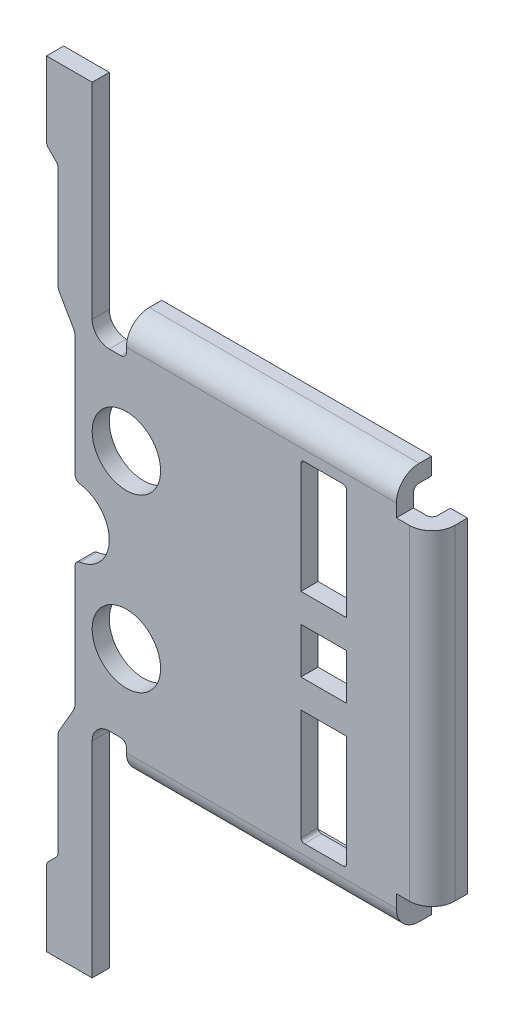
ISO-10303-21;
HEADER;
FILE_DESCRIPTION(('STEP AP214'),'2;1');
FILE_NAME('part.step','',(''),(''),'','','');
FILE_SCHEMA(('AUTOMOTIVE_DESIGN { 1 0 10303 214 1 1 1 1 }'));
ENDSEC;
DATA;
#1=APPLICATION_CONTEXT('core data for automotive mechanical design processes');
#2=APPLICATION_PROTOCOL_DEFINITION('international standard','automotive_design',2000,#1);
#3=PRODUCT_CONTEXT('',#1,'mechanical');
#4=PRODUCT('Part','Part','',(#3));
#5=PRODUCT_RELATED_PRODUCT_CATEGORY('part','',(#4));
#6=PRODUCT_DEFINITION_FORMATION('','',#4);
#7=PRODUCT_DEFINITION_CONTEXT('part definition',#1,'design');
#8=PRODUCT_DEFINITION('design','',#6,#7);
#9=PRODUCT_DEFINITION_SHAPE('','',#8);
#10=(LENGTH_UNIT() NAMED_UNIT(*) SI_UNIT(.MILLI.,.METRE.));
#11=(NAMED_UNIT(*) PLANE_ANGLE_UNIT() SI_UNIT($,.RADIAN.));
#12=(NAMED_UNIT(*) SI_UNIT($,.STERADIAN.) SOLID_ANGLE_UNIT());
#13=UNCERTAINTY_MEASURE_WITH_UNIT(LENGTH_MEASURE(1.E-05),#10,'distance_accuracy_value','');
#14=(GEOMETRIC_REPRESENTATION_CONTEXT(3) GLOBAL_UNCERTAINTY_ASSIGNED_CONTEXT((#13)) GLOBAL_UNIT_ASSIGNED_CONTEXT((#10,
#11,#12)) REPRESENTATION_CONTEXT('',''));
#15=CARTESIAN_POINT('',(0.,0.,0.));
#16=DIRECTION('',(0.,0.,1.));
#17=DIRECTION('',(1.,0.,0.));
#18=AXIS2_PLACEMENT_3D('',#15,#16,#17);
#19=CARTESIAN_POINT('',(2.18,0.,1.64859119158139));
#20=DIRECTION('',(1.,0.,0.));
#21=DIRECTION('',(0.,0.,-1.));
#22=AXIS2_PLACEMENT_3D('',#19,#20,#21);
#23=PLANE('',#22);
#24=DIRECTION('',(0.,1.,0.));
#25=VECTOR('',#24,1.);
#26=CARTESIAN_POINT('',(2.18,-1.48393398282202,1.51));
#27=LINE('',#26,#25);
#28=CARTESIAN_POINT('',(2.18,1.42639379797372,1.51));
#29=VERTEX_POINT('',#28);
#30=CARTESIAN_POINT('',(2.18,-1.42639379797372,1.51));
#31=VERTEX_POINT('',#30);
#32=EDGE_CURVE('E590',#29,#31,#27,.F.);
#33=ORIENTED_EDGE('',*,*,#32,.F.);
#34=DIRECTION('',(0.,0.,-1.));
#35=VECTOR('',#34,1.);
#36=CARTESIAN_POINT('',(2.18,1.42639379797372,1.90639379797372));
#37=LINE('',#36,#35);
#38=CARTESIAN_POINT('',(2.18,1.42639379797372,1.62));
#39=VERTEX_POINT('',#38);
#40=EDGE_CURVE('E579',#29,#39,#37,.F.);
#41=ORIENTED_EDGE('',*,*,#40,.T.);
#42=DIRECTION('',(0.,1.,0.));
#43=VECTOR('',#42,1.);
#44=CARTESIAN_POINT('',(2.18,0.,1.62));
#45=LINE('',#44,#43);
#46=CARTESIAN_POINT('',(2.18,-1.42639379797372,1.62));
#47=VERTEX_POINT('',#46);
#48=EDGE_CURVE('E531',#47,#39,#45,.T.);
#49=ORIENTED_EDGE('',*,*,#48,.F.);
#50=DIRECTION('',(0.,0.,1.));
#51=VECTOR('',#50,1.);
#52=CARTESIAN_POINT('',(2.18,-1.42639379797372,1.50639379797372));
#53=LINE('',#52,#51);
#54=EDGE_CURVE('E353',#47,#31,#53,.F.);
#55=ORIENTED_EDGE('',*,*,#54,.T.);
#56=EDGE_LOOP('',(#33,#41,#49,#55));
#57=FACE_BOUND('',#56,.T.);
#58=ADVANCED_FACE('F16',(#57),#23,.T.);
#59=CARTESIAN_POINT('',(0.691988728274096,1.74,1.64972912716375));
#60=DIRECTION('',(0.,1.,0.));
#61=DIRECTION('',(0.,0.,1.));
#62=AXIS2_PLACEMENT_3D('',#59,#60,#61);
#63=PLANE('',#62);
#64=DIRECTION('',(1.,0.,0.));
#65=VECTOR('',#64,1.);
#66=CARTESIAN_POINT('',(1.92393398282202,1.74,1.51));
#67=LINE('',#66,#65);
#68=CARTESIAN_POINT('',(-0.499999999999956,1.74,1.51));
#69=VERTEX_POINT('',#68);
#70=CARTESIAN_POINT('',(1.86639379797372,1.74,1.51));
#71=VERTEX_POINT('',#70);
#72=EDGE_CURVE('E560',#69,#71,#67,.T.);
#73=ORIENTED_EDGE('',*,*,#72,.F.);
#74=DIRECTION('',(0.,0.,1.));
#75=VECTOR('',#74,1.);
#76=CARTESIAN_POINT('',(-0.499999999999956,1.74,1.51));
#77=LINE('',#76,#75);
#78=CARTESIAN_POINT('',(-0.499999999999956,1.74,1.62));
#79=VERTEX_POINT('',#78);
#80=EDGE_CURVE('E557',#79,#69,#77,.F.);
#81=ORIENTED_EDGE('',*,*,#80,.F.);
#82=DIRECTION('',(-1.,0.,0.));
#83=VECTOR('',#82,1.);
#84=CARTESIAN_POINT('',(0.686966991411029,1.74,1.62));
#85=LINE('',#84,#83);
#86=CARTESIAN_POINT('',(1.86639379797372,1.74,1.62));
#87=VERTEX_POINT('',#86);
#88=EDGE_CURVE('E536',#87,#79,#85,.T.);
#89=ORIENTED_EDGE('',*,*,#88,.F.);
#90=DIRECTION('',(0.,0.,1.));
#91=VECTOR('',#90,1.);
#92=CARTESIAN_POINT('',(1.86639379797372,1.74,1.50639379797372));
#93=LINE('',#92,#91);
#94=EDGE_CURVE('E574',#87,#71,#93,.F.);
#95=ORIENTED_EDGE('',*,*,#94,.T.);
#96=EDGE_LOOP('',(#73,#81,#89,#95));
#97=FACE_BOUND('',#96,.T.);
#98=ADVANCED_FACE('F796',(#97),#63,.T.);
#99=CARTESIAN_POINT('',(0.691988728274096,-1.74,1.64972912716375));
#100=DIRECTION('',(0.,-1.,0.));
#101=DIRECTION('',(1.,0.,0.));
#102=AXIS2_PLACEMENT_3D('',#99,#100,#101);
#103=PLANE('',#102);
#104=DIRECTION('',(1.,0.,0.));
#105=VECTOR('',#104,1.);
#106=CARTESIAN_POINT('',(-0.499999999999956,-1.74,1.51));
#107=LINE('',#106,#105);
#108=CARTESIAN_POINT('',(1.86639379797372,-1.74,1.51));
#109=VERTEX_POINT('',#108);
#110=CARTESIAN_POINT('',(-0.499999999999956,-1.74,1.51));
#111=VERTEX_POINT('',#110);
#112=EDGE_CURVE('E548',#109,#111,#107,.F.);
#113=ORIENTED_EDGE('',*,*,#112,.F.);
#114=DIRECTION('',(0.,0.,1.));
#115=VECTOR('',#114,1.);
#116=CARTESIAN_POINT('',(1.86639379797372,-1.74,1.90639379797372));
#117=LINE('',#116,#115);
#118=CARTESIAN_POINT('',(1.86639379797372,-1.74,1.62));
#119=VERTEX_POINT('',#118);
#120=EDGE_CURVE('E528',#109,#119,#117,.T.);
#121=ORIENTED_EDGE('',*,*,#120,.T.);
#122=DIRECTION('',(1.,0.,0.));
#123=VECTOR('',#122,1.);
#124=CARTESIAN_POINT('',(0.68696699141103,-1.74,1.62));
#125=LINE('',#124,#123);
#126=CARTESIAN_POINT('',(-0.499999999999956,-1.74,1.62));
#127=VERTEX_POINT('',#126);
#128=EDGE_CURVE('E357',#127,#119,#125,.T.);
#129=ORIENTED_EDGE('',*,*,#128,.F.);
#130=DIRECTION('',(0.,0.,1.));
#131=VECTOR('',#130,1.);
#132=CARTESIAN_POINT('',(-0.499999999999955,-1.74,1.79278759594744));
#133=LINE('',#132,#131);
#134=EDGE_CURVE('E551',#111,#127,#133,.T.);
#135=ORIENTED_EDGE('',*,*,#134,.F.);
#136=EDGE_LOOP('',(#113,#121,#129,#135));
#137=FACE_BOUND('',#136,.T.);
#138=ADVANCED_FACE('F1169',(#137),#103,.T.);
#139=CARTESIAN_POINT('',(2.03,-1.48393398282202,1.51));
#140=DIRECTION('',(0.,0.,-1.));
#141=DIRECTION('',(-1.,0.,0.));
#142=AXIS2_PLACEMENT_3D('',#139,#140,#141);
#143=PLANE('',#142);
#144=DIRECTION('',(1.,0.,0.));
#145=VECTOR('',#144,1.);
#146=CARTESIAN_POINT('',(2.03,1.42639379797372,1.51));
#147=LINE('',#146,#145);
#148=CARTESIAN_POINT('',(2.03,1.42639379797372,1.51));
#149=VERTEX_POINT('',#148);
#150=EDGE_CURVE('E584',#149,#29,#147,.T.);
#151=ORIENTED_EDGE('',*,*,#150,.T.);
#152=ORIENTED_EDGE('',*,*,#32,.T.);
#153=DIRECTION('',(-1.,0.,0.));
#154=VECTOR('',#153,1.);
#155=CARTESIAN_POINT('',(2.03,-1.42639379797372,1.51));
#156=LINE('',#155,#154);
#157=CARTESIAN_POINT('',(2.03,-1.42639379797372,1.51));
#158=VERTEX_POINT('',#157);
#159=EDGE_CURVE('E597',#31,#158,#156,.T.);
#160=ORIENTED_EDGE('',*,*,#159,.T.);
#161=DIRECTION('',(0.,1.,0.));
#162=VECTOR('',#161,1.);
#163=CARTESIAN_POINT('',(2.03,0.,1.51));
#164=LINE('',#163,#162);
#165=EDGE_CURVE('E520',#158,#149,#164,.T.);
#166=ORIENTED_EDGE('',*,*,#165,.T.);
#167=EDGE_LOOP('',(#151,#152,#160,#166));
#168=FACE_BOUND('',#167,.T.);
#169=ADVANCED_FACE('F1135',(#168),#143,.T.);
#170=CARTESIAN_POINT('',(1.92393398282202,1.59,1.51));
#171=DIRECTION('',(0.,0.,-1.));
#172=DIRECTION('',(0.,1.,0.));
#173=AXIS2_PLACEMENT_3D('',#170,#171,#172);
#174=PLANE('',#173);
#175=DIRECTION('',(0.,-1.,0.));
#176=VECTOR('',#175,1.);
#177=CARTESIAN_POINT('',(-0.499999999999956,1.59,1.51));
#178=LINE('',#177,#176);
#179=CARTESIAN_POINT('',(-0.499999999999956,1.59,1.51));
#180=VERTEX_POINT('',#179);
#181=EDGE_CURVE('E553',#69,#180,#178,.T.);
#182=ORIENTED_EDGE('',*,*,#181,.F.);
#183=ORIENTED_EDGE('',*,*,#72,.T.);
#184=DIRECTION('',(0.,1.,0.));
#185=VECTOR('',#184,1.);
#186=CARTESIAN_POINT('',(1.86639379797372,1.59,1.51));
#187=LINE('',#186,#185);
#188=CARTESIAN_POINT('',(1.86639379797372,1.59,1.51));
#189=VERTEX_POINT('',#188);
#190=EDGE_CURVE('E571',#71,#189,#187,.F.);
#191=ORIENTED_EDGE('',*,*,#190,.T.);
#192=DIRECTION('',(1.,0.,0.));
#193=VECTOR('',#192,1.);
#194=CARTESIAN_POINT('',(0.691988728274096,1.59,1.51));
#195=LINE('',#194,#193);
#196=EDGE_CURVE('E494',#189,#180,#195,.F.);
#197=ORIENTED_EDGE('',*,*,#196,.T.);
#198=EDGE_LOOP('',(#182,#183,#191,#197));
#199=FACE_BOUND('',#198,.T.);
#200=ADVANCED_FACE('F1158',(#199),#174,.T.);
#201=CARTESIAN_POINT('',(-0.499999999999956,-1.59,1.51));
#202=DIRECTION('',(0.,0.,-1.));
#203=DIRECTION('',(0.,1.,0.));
#204=AXIS2_PLACEMENT_3D('',#201,#202,#203);
#205=PLANE('',#204);
#206=DIRECTION('',(0.,1.,0.));
#207=VECTOR('',#206,1.);
#208=CARTESIAN_POINT('',(-0.499999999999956,-1.59,1.51));
#209=LINE('',#208,#207);
#210=CARTESIAN_POINT('',(-0.499999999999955,-1.59,1.51));
#211=VERTEX_POINT('',#210);
#212=EDGE_CURVE('E539',#111,#211,#209,.T.);
#213=ORIENTED_EDGE('',*,*,#212,.T.);
#214=DIRECTION('',(1.,0.,0.));
#215=VECTOR('',#214,1.);
#216=CARTESIAN_POINT('',(0.691988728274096,-1.59,1.51));
#217=LINE('',#216,#215);
#218=CARTESIAN_POINT('',(1.86639379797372,-1.59,1.51));
#219=VERTEX_POINT('',#218);
#220=EDGE_CURVE('E393',#211,#219,#217,.T.);
#221=ORIENTED_EDGE('',*,*,#220,.T.);
#222=DIRECTION('',(0.,-1.,0.));
#223=VECTOR('',#222,1.);
#224=CARTESIAN_POINT('',(1.86639379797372,-1.59,1.51));
#225=LINE('',#224,#223);
#226=EDGE_CURVE('E532',#219,#109,#225,.T.);
#227=ORIENTED_EDGE('',*,*,#226,.T.);
#228=ORIENTED_EDGE('',*,*,#112,.T.);
#229=EDGE_LOOP('',(#213,#221,#227,#228));
#230=FACE_BOUND('',#229,.T.);
#231=ADVANCED_FACE('F1160',(#230),#205,.T.);
#232=CARTESIAN_POINT('',(1.98,0.,1.62));
#233=DIRECTION('',(0.,1.,0.));
#234=DIRECTION('',(-1.,0.,0.));
#235=AXIS2_PLACEMENT_3D('',#232,#233,#234);
#236=CYLINDRICAL_SURFACE('',#235,0.2);
#237=DIRECTION('',(0.,-1.,0.));
#238=VECTOR('',#237,1.);
#239=CARTESIAN_POINT('',(1.98,0.,1.82));
#240=LINE('',#239,#238);
#241=CARTESIAN_POINT('',(1.98,-1.42639379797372,1.82));
#242=VERTEX_POINT('',#241);
#243=CARTESIAN_POINT('',(1.98,1.42639379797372,1.82));
#244=VERTEX_POINT('',#243);
#245=EDGE_CURVE('E359',#242,#244,#240,.F.);
#246=ORIENTED_EDGE('',*,*,#245,.F.);
#247=CARTESIAN_POINT('',(1.98,-1.42639379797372,1.62));
#248=DIRECTION('',(0.,1.,0.));
#249=DIRECTION('',(-1.,0.,0.));
#250=AXIS2_PLACEMENT_3D('',#247,#248,#249);
#251=CIRCLE('',#250,0.2);
#252=EDGE_CURVE('E19',#242,#47,#251,.T.);
#253=ORIENTED_EDGE('',*,*,#252,.T.);
#254=ORIENTED_EDGE('',*,*,#48,.T.);
#255=CARTESIAN_POINT('',(1.98,1.42639379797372,1.62));
#256=DIRECTION('',(0.,1.,0.));
#257=DIRECTION('',(-1.,0.,0.));
#258=AXIS2_PLACEMENT_3D('',#255,#256,#257);
#259=CIRCLE('',#258,0.2);
#260=EDGE_CURVE('E362',#39,#244,#259,.F.);
#261=ORIENTED_EDGE('',*,*,#260,.T.);
#262=EDGE_LOOP('',(#246,#253,#254,#261));
#263=FACE_BOUND('',#262,.T.);
#264=ADVANCED_FACE('F360',(#263),#236,.T.);
#265=CARTESIAN_POINT('',(0.686966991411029,1.54,1.62));
#266=DIRECTION('',(-1.,0.,0.));
#267=DIRECTION('',(0.,-1.,0.));
#268=AXIS2_PLACEMENT_3D('',#265,#266,#267);
#269=CYLINDRICAL_SURFACE('',#268,0.2);
#270=DIRECTION('',(1.,0.,0.));
#271=VECTOR('',#270,1.);
#272=CARTESIAN_POINT('',(0.39,1.54,1.82));
#273=LINE('',#272,#271);
#274=CARTESIAN_POINT('',(1.86639379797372,1.54,1.82));
#275=VERTEX_POINT('',#274);
#276=CARTESIAN_POINT('',(-0.499999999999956,1.54,1.82));
#277=VERTEX_POINT('',#276);
#278=EDGE_CURVE('E366',#275,#277,#273,.F.);
#279=ORIENTED_EDGE('',*,*,#278,.F.);
#280=CARTESIAN_POINT('',(1.86639379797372,1.54,1.62));
#281=DIRECTION('',(-1.,0.,0.));
#282=DIRECTION('',(0.,-1.,0.));
#283=AXIS2_PLACEMENT_3D('',#280,#281,#282);
#284=CIRCLE('',#283,0.2);
#285=EDGE_CURVE('E495',#275,#87,#284,.T.);
#286=ORIENTED_EDGE('',*,*,#285,.T.);
#287=ORIENTED_EDGE('',*,*,#88,.T.);
#288=CARTESIAN_POINT('',(-0.499999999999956,1.54,1.62));
#289=DIRECTION('',(-1.,0.,0.));
#290=DIRECTION('',(0.,-1.,0.));
#291=AXIS2_PLACEMENT_3D('',#288,#289,#290);
#292=CIRCLE('',#291,0.2);
#293=EDGE_CURVE('E501',#277,#79,#292,.T.);
#294=ORIENTED_EDGE('',*,*,#293,.F.);
#295=EDGE_LOOP('',(#279,#286,#287,#294));
#296=FACE_BOUND('',#295,.T.);
#297=ADVANCED_FACE('F783',(#296),#269,.T.);
#298=CARTESIAN_POINT('',(0.68696699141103,-1.54,1.62));
#299=DIRECTION('',(1.,0.,0.));
#300=DIRECTION('',(0.,1.,0.));
#301=AXIS2_PLACEMENT_3D('',#298,#299,#300);
#302=CYLINDRICAL_SURFACE('',#301,0.2);
#303=DIRECTION('',(1.,0.,0.));
#304=VECTOR('',#303,1.);
#305=CARTESIAN_POINT('',(0.39,-1.54,1.82));
#306=LINE('',#305,#304);
#307=CARTESIAN_POINT('',(-0.499999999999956,-1.54,1.82));
#308=VERTEX_POINT('',#307);
#309=CARTESIAN_POINT('',(1.86639379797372,-1.54,1.82));
#310=VERTEX_POINT('',#309);
#311=EDGE_CURVE('E375',#308,#310,#306,.T.);
#312=ORIENTED_EDGE('',*,*,#311,.F.);
#313=CARTESIAN_POINT('',(-0.499999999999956,-1.54,1.62));
#314=DIRECTION('',(1.,0.,0.));
#315=DIRECTION('',(0.,1.,0.));
#316=AXIS2_PLACEMENT_3D('',#313,#314,#315);
#317=CIRCLE('',#316,0.2);
#318=EDGE_CURVE('E394',#127,#308,#317,.F.);
#319=ORIENTED_EDGE('',*,*,#318,.F.);
#320=ORIENTED_EDGE('',*,*,#128,.T.);
#321=CARTESIAN_POINT('',(1.86639379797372,-1.54,1.62));
#322=DIRECTION('',(1.,0.,0.));
#323=DIRECTION('',(0.,1.,0.));
#324=AXIS2_PLACEMENT_3D('',#321,#322,#323);
#325=CIRCLE('',#324,0.2);
#326=EDGE_CURVE('E367',#119,#310,#325,.F.);
#327=ORIENTED_EDGE('',*,*,#326,.T.);
#328=EDGE_LOOP('',(#312,#319,#320,#327));
#329=FACE_BOUND('',#328,.T.);
#330=ADVANCED_FACE('F1391',(#329),#302,.T.);
#331=CARTESIAN_POINT('',(2.03,0.,1.64859119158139));
#332=DIRECTION('',(1.,0.,0.));
#333=DIRECTION('',(0.,0.,-1.));
#334=AXIS2_PLACEMENT_3D('',#331,#332,#333);
#335=PLANE('',#334);
#336=DIRECTION('',(0.,0.,-1.));
#337=VECTOR('',#336,1.);
#338=CARTESIAN_POINT('',(2.03,1.42639379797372,1.64859119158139));
#339=LINE('',#338,#337);
#340=CARTESIAN_POINT('',(2.03,1.42639379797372,1.62));
#341=VERTEX_POINT('',#340);
#342=EDGE_CURVE('E523',#149,#341,#339,.F.);
#343=ORIENTED_EDGE('',*,*,#342,.F.);
#344=ORIENTED_EDGE('',*,*,#165,.F.);
#345=DIRECTION('',(0.,0.,-1.));
#346=VECTOR('',#345,1.);
#347=CARTESIAN_POINT('',(2.03,-1.42639379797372,1.64859119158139));
#348=LINE('',#347,#346);
#349=CARTESIAN_POINT('',(2.03,-1.42639379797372,1.62));
#350=VERTEX_POINT('',#349);
#351=EDGE_CURVE('E356',#350,#158,#348,.T.);
#352=ORIENTED_EDGE('',*,*,#351,.F.);
#353=DIRECTION('',(0.,1.,0.));
#354=VECTOR('',#353,1.);
#355=CARTESIAN_POINT('',(2.03,0.,1.62));
#356=LINE('',#355,#354);
#357=EDGE_CURVE('E513',#350,#341,#356,.T.);
#358=ORIENTED_EDGE('',*,*,#357,.T.);
#359=EDGE_LOOP('',(#343,#344,#352,#358));
#360=FACE_BOUND('',#359,.T.);
#361=ADVANCED_FACE('F1140',(#360),#335,.F.);
#362=CARTESIAN_POINT('',(0.691988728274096,1.59,1.64972912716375));
#363=DIRECTION('',(0.,1.,0.));
#364=DIRECTION('',(0.,0.,1.));
#365=AXIS2_PLACEMENT_3D('',#362,#363,#364);
#366=PLANE('',#365);
#367=DIRECTION('',(0.,0.,1.));
#368=VECTOR('',#367,1.);
#369=CARTESIAN_POINT('',(-0.499999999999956,1.59,1.64972912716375));
#370=LINE('',#369,#368);
#371=CARTESIAN_POINT('',(-0.499999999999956,1.59,1.62));
#372=VERTEX_POINT('',#371);
#373=EDGE_CURVE('E498',#180,#372,#370,.T.);
#374=ORIENTED_EDGE('',*,*,#373,.F.);
#375=ORIENTED_EDGE('',*,*,#196,.F.);
#376=DIRECTION('',(0.,0.,1.));
#377=VECTOR('',#376,1.);
#378=CARTESIAN_POINT('',(1.86639379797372,1.59,1.64972912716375));
#379=LINE('',#378,#377);
#380=CARTESIAN_POINT('',(1.86639379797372,1.59,1.62));
#381=VERTEX_POINT('',#380);
#382=EDGE_CURVE('E491',#381,#189,#379,.F.);
#383=ORIENTED_EDGE('',*,*,#382,.F.);
#384=DIRECTION('',(-1.,0.,0.));
#385=VECTOR('',#384,1.);
#386=CARTESIAN_POINT('',(0.686966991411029,1.59,1.62));
#387=LINE('',#386,#385);
#388=EDGE_CURVE('E486',#381,#372,#387,.T.);
#389=ORIENTED_EDGE('',*,*,#388,.T.);
#390=EDGE_LOOP('',(#374,#375,#383,#389));
#391=FACE_BOUND('',#390,.T.);
#392=ADVANCED_FACE('F1156',(#391),#366,.F.);
#393=CARTESIAN_POINT('',(0.691988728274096,-1.59,1.64972912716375));
#394=DIRECTION('',(0.,-1.,0.));
#395=DIRECTION('',(1.,0.,0.));
#396=AXIS2_PLACEMENT_3D('',#393,#394,#395);
#397=PLANE('',#396);
#398=DIRECTION('',(0.,0.,1.));
#399=VECTOR('',#398,1.);
#400=CARTESIAN_POINT('',(1.86639379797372,-1.59,1.64972912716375));
#401=LINE('',#400,#399);
#402=CARTESIAN_POINT('',(1.86639379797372,-1.59,1.62));
#403=VERTEX_POINT('',#402);
#404=EDGE_CURVE('E397',#219,#403,#401,.T.);
#405=ORIENTED_EDGE('',*,*,#404,.F.);
#406=ORIENTED_EDGE('',*,*,#220,.F.);
#407=DIRECTION('',(0.,0.,1.));
#408=VECTOR('',#407,1.);
#409=CARTESIAN_POINT('',(-0.499999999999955,-1.59,1.64972912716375));
#410=LINE('',#409,#408);
#411=CARTESIAN_POINT('',(-0.499999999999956,-1.59,1.62));
#412=VERTEX_POINT('',#411);
#413=EDGE_CURVE('E390',#412,#211,#410,.F.);
#414=ORIENTED_EDGE('',*,*,#413,.F.);
#415=DIRECTION('',(1.,0.,0.));
#416=VECTOR('',#415,1.);
#417=CARTESIAN_POINT('',(0.68696699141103,-1.59,1.62));
#418=LINE('',#417,#416);
#419=EDGE_CURVE('E386',#412,#403,#418,.T.);
#420=ORIENTED_EDGE('',*,*,#419,.T.);
#421=EDGE_LOOP('',(#405,#406,#414,#420));
#422=FACE_BOUND('',#421,.T.);
#423=ADVANCED_FACE('F1382',(#422),#397,.F.);
#424=CARTESIAN_POINT('',(0.39,0.,1.82));
#425=DIRECTION('',(0.,0.,1.));
#426=DIRECTION('',(0.,-1.,0.));
#427=AXIS2_PLACEMENT_3D('',#424,#425,#426);
#428=PLANE('',#427);
#429=CARTESIAN_POINT('',(-0.5,0.75,1.82));
#430=DIRECTION('',(0.,0.,-1.));
#431=DIRECTION('',(-1.,0.,0.));
#432=AXIS2_PLACEMENT_3D('',#429,#430,#431);
#433=CIRCLE('',#432,0.3);
#434=CARTESIAN_POINT('',(-0.8,0.75,1.82));
#435=VERTEX_POINT('',#434);
#436=EDGE_CURVE('E698',#435,#435,#433,.T.);
#437=ORIENTED_EDGE('',*,*,#436,.T.);
#438=EDGE_LOOP('',(#437));
#439=FACE_BOUND('',#438,.T.);
#440=CARTESIAN_POINT('',(-0.5,-0.749999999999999,1.82));
#441=DIRECTION('',(0.,0.,-1.));
#442=DIRECTION('',(-1.,0.,0.));
#443=AXIS2_PLACEMENT_3D('',#440,#441,#442);
#444=CIRCLE('',#443,0.3);
#445=CARTESIAN_POINT('',(-0.8,-0.749999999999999,1.82));
#446=VERTEX_POINT('',#445);
#447=EDGE_CURVE('E702',#446,#446,#444,.T.);
#448=ORIENTED_EDGE('',*,*,#447,.T.);
#449=EDGE_LOOP('',(#448));
#450=FACE_BOUND('',#449,.T.);
#451=DIRECTION('',(1.,0.,0.));
#452=VECTOR('',#451,1.);
#453=CARTESIAN_POINT('',(1.4,1.45,1.82));
#454=LINE('',#453,#452);
#455=CARTESIAN_POINT('',(1.4,1.45,1.82));
#456=VERTEX_POINT('',#455);
#457=CARTESIAN_POINT('',(1.06,1.45,1.82));
#458=VERTEX_POINT('',#457);
#459=EDGE_CURVE('E714',#456,#458,#454,.F.);
#460=ORIENTED_EDGE('',*,*,#459,.F.);
#461=CARTESIAN_POINT('',(1.4,1.42,1.82));
#462=DIRECTION('',(0.,0.,-1.));
#463=DIRECTION('',(-1.,0.,0.));
#464=AXIS2_PLACEMENT_3D('',#461,#462,#463);
#465=CIRCLE('',#464,0.0299999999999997);
#466=CARTESIAN_POINT('',(1.43,1.42,1.82));
#467=VERTEX_POINT('',#466);
#468=EDGE_CURVE('E706',#456,#467,#465,.T.);
#469=ORIENTED_EDGE('',*,*,#468,.T.);
#470=DIRECTION('',(0.,-1.,0.));
#471=VECTOR('',#470,1.);
#472=CARTESIAN_POINT('',(1.43,0.450000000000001,1.82));
#473=LINE('',#472,#471);
#474=CARTESIAN_POINT('',(1.43,0.450000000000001,1.82));
#475=VERTEX_POINT('',#474);
#476=EDGE_CURVE('E709',#475,#467,#473,.F.);
#477=ORIENTED_EDGE('',*,*,#476,.F.);
#478=DIRECTION('',(-1.,0.,0.));
#479=VECTOR('',#478,1.);
#480=CARTESIAN_POINT('',(1.03,0.450000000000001,1.82));
#481=LINE('',#480,#479);
#482=CARTESIAN_POINT('',(1.03,0.450000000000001,1.82));
#483=VERTEX_POINT('',#482);
#484=EDGE_CURVE('E852',#483,#475,#481,.F.);
#485=ORIENTED_EDGE('',*,*,#484,.F.);
#486=DIRECTION('',(0.,1.,0.));
#487=VECTOR('',#486,1.);
#488=CARTESIAN_POINT('',(1.03,1.42,1.82));
#489=LINE('',#488,#487);
#490=CARTESIAN_POINT('',(1.03,1.42,1.82));
#491=VERTEX_POINT('',#490);
#492=EDGE_CURVE('E855',#491,#483,#489,.F.);
#493=ORIENTED_EDGE('',*,*,#492,.F.);
#494=CARTESIAN_POINT('',(1.06,1.42,1.82));
#495=DIRECTION('',(0.,0.,-1.));
#496=DIRECTION('',(-1.,0.,0.));
#497=AXIS2_PLACEMENT_3D('',#494,#495,#496);
#498=CIRCLE('',#497,0.03);
#499=EDGE_CURVE('E711',#491,#458,#498,.T.);
#500=ORIENTED_EDGE('',*,*,#499,.T.);
#501=EDGE_LOOP('',(#460,#469,#477,#485,#493,#500));
#502=FACE_BOUND('',#501,.T.);
#503=DIRECTION('',(-1.,0.,0.));
#504=VECTOR('',#503,1.);
#505=CARTESIAN_POINT('',(1.06,-1.45,1.82));
#506=LINE('',#505,#504);
#507=CARTESIAN_POINT('',(1.06,-1.45,1.82));
#508=VERTEX_POINT('',#507);
#509=CARTESIAN_POINT('',(1.4,-1.45,1.82));
#510=VERTEX_POINT('',#509);
#511=EDGE_CURVE('E724',#508,#510,#506,.F.);
#512=ORIENTED_EDGE('',*,*,#511,.F.);
#513=CARTESIAN_POINT('',(1.06,-1.42,1.82));
#514=DIRECTION('',(0.,0.,-1.));
#515=DIRECTION('',(-1.,0.,0.));
#516=AXIS2_PLACEMENT_3D('',#513,#514,#515);
#517=CIRCLE('',#516,0.03);
#518=CARTESIAN_POINT('',(1.03,-1.42,1.82));
#519=VERTEX_POINT('',#518);
#520=EDGE_CURVE('E716',#508,#519,#517,.T.);
#521=ORIENTED_EDGE('',*,*,#520,.T.);
#522=DIRECTION('',(0.,1.,0.));
#523=VECTOR('',#522,1.);
#524=CARTESIAN_POINT('',(1.03,-0.45,1.82));
#525=LINE('',#524,#523);
#526=CARTESIAN_POINT('',(1.03,-0.45,1.82));
#527=VERTEX_POINT('',#526);
#528=EDGE_CURVE('E719',#527,#519,#525,.F.);
#529=ORIENTED_EDGE('',*,*,#528,.F.);
#530=DIRECTION('',(1.,0.,0.));
#531=VECTOR('',#530,1.);
#532=CARTESIAN_POINT('',(1.43,-0.45,1.82));
#533=LINE('',#532,#531);
#534=CARTESIAN_POINT('',(1.43,-0.45,1.82));
#535=VERTEX_POINT('',#534);
#536=EDGE_CURVE('E869',#535,#527,#533,.F.);
#537=ORIENTED_EDGE('',*,*,#536,.F.);
#538=DIRECTION('',(0.,-1.,0.));
#539=VECTOR('',#538,1.);
#540=CARTESIAN_POINT('',(1.43,-1.42,1.82));
#541=LINE('',#540,#539);
#542=CARTESIAN_POINT('',(1.43,-1.42,1.82));
#543=VERTEX_POINT('',#542);
#544=EDGE_CURVE('E872',#543,#535,#541,.F.);
#545=ORIENTED_EDGE('',*,*,#544,.F.);
#546=CARTESIAN_POINT('',(1.4,-1.42,1.82));
#547=DIRECTION('',(0.,0.,-1.));
#548=DIRECTION('',(-1.,0.,0.));
#549=AXIS2_PLACEMENT_3D('',#546,#547,#548);
#550=CIRCLE('',#549,0.0299999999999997);
#551=EDGE_CURVE('E721',#543,#510,#550,.T.);
#552=ORIENTED_EDGE('',*,*,#551,.T.);
#553=EDGE_LOOP('',(#512,#521,#529,#537,#545,#552));
#554=FACE_BOUND('',#553,.T.);
#555=DIRECTION('',(0.,1.,0.));
#556=VECTOR('',#555,1.);
#557=CARTESIAN_POINT('',(1.43,-0.199999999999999,1.82));
#558=LINE('',#557,#556);
#559=CARTESIAN_POINT('',(1.43,-0.199999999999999,1.82));
#560=VERTEX_POINT('',#559);
#561=CARTESIAN_POINT('',(1.43,0.2,1.82));
#562=VERTEX_POINT('',#561);
#563=EDGE_CURVE('E916',#560,#562,#558,.T.);
#564=ORIENTED_EDGE('',*,*,#563,.F.);
#565=DIRECTION('',(-1.,0.,0.));
#566=VECTOR('',#565,1.);
#567=CARTESIAN_POINT('',(1.03,-0.199999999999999,1.82));
#568=LINE('',#567,#566);
#569=CARTESIAN_POINT('',(1.03,-0.199999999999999,1.82));
#570=VERTEX_POINT('',#569);
#571=EDGE_CURVE('E910',#570,#560,#568,.F.);
#572=ORIENTED_EDGE('',*,*,#571,.F.);
#573=DIRECTION('',(0.,1.,0.));
#574=VECTOR('',#573,1.);
#575=CARTESIAN_POINT('',(1.03,0.2,1.82));
#576=LINE('',#575,#574);
#577=CARTESIAN_POINT('',(1.03,0.2,1.82));
#578=VERTEX_POINT('',#577);
#579=EDGE_CURVE('E904',#578,#570,#576,.F.);
#580=ORIENTED_EDGE('',*,*,#579,.F.);
#581=DIRECTION('',(1.,0.,0.));
#582=VECTOR('',#581,1.);
#583=CARTESIAN_POINT('',(1.43,0.2,1.82));
#584=LINE('',#583,#582);
#585=EDGE_CURVE('E842',#562,#578,#584,.F.);
#586=ORIENTED_EDGE('',*,*,#585,.F.);
#587=EDGE_LOOP('',(#564,#572,#580,#586));
#588=FACE_BOUND('',#587,.T.);
#589=DIRECTION('',(-1.19695919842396E-13,-1.,0.));
#590=VECTOR('',#589,1.);
#591=CARTESIAN_POINT('',(-0.499999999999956,-1.54,1.82));
#592=LINE('',#591,#590);
#593=CARTESIAN_POINT('',(-0.499999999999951,-1.5,1.82));
#594=VERTEX_POINT('',#593);
#595=EDGE_CURVE('E402',#308,#594,#592,.F.);
#596=ORIENTED_EDGE('',*,*,#595,.F.);
#597=ORIENTED_EDGE('',*,*,#311,.T.);
#598=DIRECTION('',(0.,-1.,0.));
#599=VECTOR('',#598,1.);
#600=CARTESIAN_POINT('',(1.86639379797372,-1.42639379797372,1.82));
#601=LINE('',#600,#599);
#602=CARTESIAN_POINT('',(1.86639379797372,-1.42639379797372,1.82));
#603=VERTEX_POINT('',#602);
#604=EDGE_CURVE('E373',#310,#603,#601,.F.);
#605=ORIENTED_EDGE('',*,*,#604,.T.);
#606=DIRECTION('',(-1.,0.,0.));
#607=VECTOR('',#606,1.);
#608=CARTESIAN_POINT('',(2.26639379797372,-1.42639379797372,1.82));
#609=LINE('',#608,#607);
#610=EDGE_CURVE('E349',#603,#242,#609,.F.);
#611=ORIENTED_EDGE('',*,*,#610,.T.);
#612=ORIENTED_EDGE('',*,*,#245,.T.);
#613=DIRECTION('',(1.,0.,0.));
#614=VECTOR('',#613,1.);
#615=CARTESIAN_POINT('',(1.86639379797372,1.42639379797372,1.82));
#616=LINE('',#615,#614);
#617=CARTESIAN_POINT('',(1.86639379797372,1.42639379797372,1.82));
#618=VERTEX_POINT('',#617);
#619=EDGE_CURVE('E511',#244,#618,#616,.F.);
#620=ORIENTED_EDGE('',*,*,#619,.T.);
#621=DIRECTION('',(0.,-1.,0.));
#622=VECTOR('',#621,1.);
#623=CARTESIAN_POINT('',(1.86639379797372,1.82639379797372,1.82));
#624=LINE('',#623,#622);
#625=EDGE_CURVE('E504',#618,#275,#624,.F.);
#626=ORIENTED_EDGE('',*,*,#625,.T.);
#627=ORIENTED_EDGE('',*,*,#278,.T.);
#628=DIRECTION('',(0.,-1.,0.));
#629=VECTOR('',#628,1.);
#630=CARTESIAN_POINT('',(-0.499999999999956,1.5,1.82));
#631=LINE('',#630,#629);
#632=CARTESIAN_POINT('',(-0.499999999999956,1.5,1.82));
#633=VERTEX_POINT('',#632);
#634=EDGE_CURVE('E482',#633,#277,#631,.F.);
#635=ORIENTED_EDGE('',*,*,#634,.F.);
#636=CARTESIAN_POINT('',(-0.549999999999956,1.5,1.82));
#637=DIRECTION('',(0.,0.,-1.));
#638=DIRECTION('',(-1.,0.,0.));
#639=AXIS2_PLACEMENT_3D('',#636,#637,#638);
#640=CIRCLE('',#639,0.05);
#641=CARTESIAN_POINT('',(-0.549999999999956,1.45,1.82));
#642=VERTEX_POINT('',#641);
#643=EDGE_CURVE('E481',#633,#642,#640,.T.);
#644=ORIENTED_EDGE('',*,*,#643,.T.);
#645=DIRECTION('',(-1.,0.,0.));
#646=VECTOR('',#645,1.);
#647=CARTESIAN_POINT('',(-0.649999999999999,1.45,1.82));
#648=LINE('',#647,#646);
#649=CARTESIAN_POINT('',(-0.649999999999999,1.45,1.82));
#650=VERTEX_POINT('',#649);
#651=EDGE_CURVE('E478',#650,#642,#648,.F.);
#652=ORIENTED_EDGE('',*,*,#651,.F.);
#653=CARTESIAN_POINT('',(-0.649999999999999,1.6,1.82));
#654=DIRECTION('',(0.,0.,-1.));
#655=DIRECTION('',(-1.,0.,0.));
#656=AXIS2_PLACEMENT_3D('',#653,#654,#655);
#657=CIRCLE('',#656,0.150000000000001);
#658=CARTESIAN_POINT('',(-0.8,1.6,1.82));
#659=VERTEX_POINT('',#658);
#660=EDGE_CURVE('E475',#650,#659,#657,.T.);
#661=ORIENTED_EDGE('',*,*,#660,.T.);
#662=DIRECTION('',(0.,1.,0.));
#663=VECTOR('',#662,1.);
#664=CARTESIAN_POINT('',(-0.8,3.4,1.82));
#665=LINE('',#664,#663);
#666=CARTESIAN_POINT('',(-0.8,3.4,1.82));
#667=VERTEX_POINT('',#666);
#668=EDGE_CURVE('E473',#667,#659,#665,.F.);
#669=ORIENTED_EDGE('',*,*,#668,.F.);
#670=DIRECTION('',(1.,0.,0.));
#671=VECTOR('',#670,1.);
#672=CARTESIAN_POINT('',(-1.2,3.4,1.82));
#673=LINE('',#672,#671);
#674=CARTESIAN_POINT('',(-1.2,3.4,1.82));
#675=VERTEX_POINT('',#674);
#676=EDGE_CURVE('E467',#675,#667,#673,.T.);
#677=ORIENTED_EDGE('',*,*,#676,.F.);
#678=DIRECTION('',(0.,-1.,0.));
#679=VECTOR('',#678,1.);
#680=CARTESIAN_POINT('',(-1.2,2.74571067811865,1.82));
#681=LINE('',#680,#679);
#682=CARTESIAN_POINT('',(-1.2,2.74571067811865,1.82));
#683=VERTEX_POINT('',#682);
#684=EDGE_CURVE('E460',#683,#675,#681,.F.);
#685=ORIENTED_EDGE('',*,*,#684,.F.);
#686=CARTESIAN_POINT('',(-1.15,2.74571067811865,1.82));
#687=DIRECTION('',(0.,0.,-1.));
#688=DIRECTION('',(-1.,0.,0.));
#689=AXIS2_PLACEMENT_3D('',#686,#687,#688);
#690=CIRCLE('',#689,0.05);
#691=CARTESIAN_POINT('',(-1.18535533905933,2.71035533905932,1.82));
#692=VERTEX_POINT('',#691);
#693=EDGE_CURVE('E763',#692,#683,#690,.T.);
#694=ORIENTED_EDGE('',*,*,#693,.F.);
#695=DIRECTION('',(0.707106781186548,-0.707106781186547,0.));
#696=VECTOR('',#695,1.);
#697=CARTESIAN_POINT('',(-1.11464466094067,2.63964466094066,1.82));
#698=LINE('',#697,#696);
#699=CARTESIAN_POINT('',(-1.11464466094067,2.63964466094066,1.82));
#700=VERTEX_POINT('',#699);
#701=EDGE_CURVE('E456',#700,#692,#698,.F.);
#702=ORIENTED_EDGE('',*,*,#701,.F.);
#703=CARTESIAN_POINT('',(-1.15,2.60428932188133,1.82));
#704=DIRECTION('',(0.,0.,-1.));
#705=DIRECTION('',(-1.,0.,0.));
#706=AXIS2_PLACEMENT_3D('',#703,#704,#705);
#707=CIRCLE('',#706,0.05);
#708=CARTESIAN_POINT('',(-1.1,2.60428932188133,1.82));
#709=VERTEX_POINT('',#708);
#710=EDGE_CURVE('E455',#700,#709,#707,.T.);
#711=ORIENTED_EDGE('',*,*,#710,.T.);
#712=DIRECTION('',(0.,1.,0.));
#713=VECTOR('',#712,1.);
#714=CARTESIAN_POINT('',(-1.1,1.71177808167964,1.82));
#715=LINE('',#714,#713);
#716=CARTESIAN_POINT('',(-1.1,1.71177808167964,1.82));
#717=VERTEX_POINT('',#716);
#718=EDGE_CURVE('E452',#717,#709,#715,.T.);
#719=ORIENTED_EDGE('',*,*,#718,.F.);
#720=CARTESIAN_POINT('',(-0.999999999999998,1.71177808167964,1.82));
#721=DIRECTION('',(0.,0.,-1.));
#722=DIRECTION('',(-1.,0.,0.));
#723=AXIS2_PLACEMENT_3D('',#720,#721,#722);
#724=CIRCLE('',#723,0.1);
#725=CARTESIAN_POINT('',(-1.08661858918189,1.66180588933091,1.82));
#726=VERTEX_POINT('',#725);
#727=EDGE_CURVE('E758',#726,#717,#724,.T.);
#728=ORIENTED_EDGE('',*,*,#727,.F.);
#729=DIRECTION('',(0.499721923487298,-0.86618589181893,0.));
#730=VECTOR('',#729,1.);
#731=CARTESIAN_POINT('',(-0.963381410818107,1.44819447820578,1.82));
#732=LINE('',#731,#730);
#733=CARTESIAN_POINT('',(-0.963381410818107,1.44819447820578,1.82));
#734=VERTEX_POINT('',#733);
#735=EDGE_CURVE('E448',#734,#726,#732,.F.);
#736=ORIENTED_EDGE('',*,*,#735,.F.);
#737=CARTESIAN_POINT('',(-1.05,1.39822228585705,1.82));
#738=DIRECTION('',(0.,0.,-1.));
#739=DIRECTION('',(-1.,0.,0.));
#740=AXIS2_PLACEMENT_3D('',#737,#738,#739);
#741=CIRCLE('',#740,0.0999999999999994);
#742=CARTESIAN_POINT('',(-0.95,1.39822228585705,1.82));
#743=VERTEX_POINT('',#742);
#744=EDGE_CURVE('E447',#734,#743,#741,.T.);
#745=ORIENTED_EDGE('',*,*,#744,.T.);
#746=DIRECTION('',(0.,-1.,0.));
#747=VECTOR('',#746,1.);
#748=CARTESIAN_POINT('',(-0.95,0.346410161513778,1.82));
#749=LINE('',#748,#747);
#750=CARTESIAN_POINT('',(-0.95,0.346410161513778,1.82));
#751=VERTEX_POINT('',#750);
#752=EDGE_CURVE('E444',#751,#743,#749,.F.);
#753=ORIENTED_EDGE('',*,*,#752,.F.);
#754=CARTESIAN_POINT('',(-0.9,0.346410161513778,1.82));
#755=DIRECTION('',(0.,0.,-1.));
#756=DIRECTION('',(-1.,0.,0.));
#757=AXIS2_PLACEMENT_3D('',#754,#755,#756);
#758=CIRCLE('',#757,0.05);
#759=CARTESIAN_POINT('',(-0.907142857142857,0.296922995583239,1.82));
#760=VERTEX_POINT('',#759);
#761=EDGE_CURVE('E752',#760,#751,#758,.T.);
#762=ORIENTED_EDGE('',*,*,#761,.F.);
#763=CARTESIAN_POINT('',(-0.95,0.,1.82));
#764=DIRECTION('',(0.,0.,-1.));
#765=DIRECTION('',(-1.,0.,0.));
#766=AXIS2_PLACEMENT_3D('',#763,#764,#765);
#767=CIRCLE('',#766,0.300000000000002);
#768=CARTESIAN_POINT('',(-0.907142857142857,-0.296922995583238,1.82));
#769=VERTEX_POINT('',#768);
#770=EDGE_CURVE('E748',#760,#769,#767,.T.);
#771=ORIENTED_EDGE('',*,*,#770,.T.);
#772=CARTESIAN_POINT('',(-0.9,-0.346410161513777,1.82));
#773=DIRECTION('',(0.,0.,-1.));
#774=DIRECTION('',(-1.,0.,0.));
#775=AXIS2_PLACEMENT_3D('',#772,#773,#774);
#776=CIRCLE('',#775,0.0500000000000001);
#777=CARTESIAN_POINT('',(-0.95,-0.346410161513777,1.82));
#778=VERTEX_POINT('',#777);
#779=EDGE_CURVE('E746',#778,#769,#776,.T.);
#780=ORIENTED_EDGE('',*,*,#779,.F.);
#781=DIRECTION('',(0.,-1.,0.));
#782=VECTOR('',#781,1.);
#783=CARTESIAN_POINT('',(-0.95,-1.39822228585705,1.82));
#784=LINE('',#783,#782);
#785=CARTESIAN_POINT('',(-0.95,-1.39822228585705,1.82));
#786=VERTEX_POINT('',#785);
#787=EDGE_CURVE('E440',#786,#778,#784,.F.);
#788=ORIENTED_EDGE('',*,*,#787,.F.);
#789=CARTESIAN_POINT('',(-1.05,-1.39822228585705,1.82));
#790=DIRECTION('',(0.,0.,-1.));
#791=DIRECTION('',(-1.,0.,0.));
#792=AXIS2_PLACEMENT_3D('',#789,#790,#791);
#793=CIRCLE('',#792,0.0999999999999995);
#794=CARTESIAN_POINT('',(-0.963381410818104,-1.44819447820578,1.82));
#795=VERTEX_POINT('',#794);
#796=EDGE_CURVE('E439',#786,#795,#793,.T.);
#797=ORIENTED_EDGE('',*,*,#796,.T.);
#798=DIRECTION('',(-0.499721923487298,-0.86618589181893,0.));
#799=VECTOR('',#798,1.);
#800=CARTESIAN_POINT('',(-1.08661858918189,-1.66180588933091,1.82));
#801=LINE('',#800,#799);
#802=CARTESIAN_POINT('',(-1.08661858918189,-1.66180588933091,1.82));
#803=VERTEX_POINT('',#802);
#804=EDGE_CURVE('E436',#803,#795,#801,.F.);
#805=ORIENTED_EDGE('',*,*,#804,.F.);
#806=CARTESIAN_POINT('',(-0.999999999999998,-1.71177808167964,1.82));
#807=DIRECTION('',(0.,0.,-1.));
#808=DIRECTION('',(-1.,0.,0.));
#809=AXIS2_PLACEMENT_3D('',#806,#807,#808);
#810=CIRCLE('',#809,0.1);
#811=CARTESIAN_POINT('',(-1.1,-1.71177808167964,1.82));
#812=VERTEX_POINT('',#811);
#813=EDGE_CURVE('E741',#812,#803,#810,.T.);
#814=ORIENTED_EDGE('',*,*,#813,.F.);
#815=DIRECTION('',(0.,-1.,0.));
#816=VECTOR('',#815,1.);
#817=CARTESIAN_POINT('',(-1.1,-2.60428932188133,1.82));
#818=LINE('',#817,#816);
#819=CARTESIAN_POINT('',(-1.1,-2.60428932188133,1.82));
#820=VERTEX_POINT('',#819);
#821=EDGE_CURVE('E432',#820,#812,#818,.F.);
#822=ORIENTED_EDGE('',*,*,#821,.F.);
#823=CARTESIAN_POINT('',(-1.15,-2.60428932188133,1.82));
#824=DIRECTION('',(0.,0.,-1.));
#825=DIRECTION('',(-1.,0.,0.));
#826=AXIS2_PLACEMENT_3D('',#823,#824,#825);
#827=CIRCLE('',#826,0.0500000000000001);
#828=CARTESIAN_POINT('',(-1.11464466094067,-2.63964466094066,1.82));
#829=VERTEX_POINT('',#828);
#830=EDGE_CURVE('E431',#820,#829,#827,.T.);
#831=ORIENTED_EDGE('',*,*,#830,.T.);
#832=DIRECTION('',(-0.707106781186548,-0.707106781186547,0.));
#833=VECTOR('',#832,1.);
#834=CARTESIAN_POINT('',(-1.18535533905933,-2.71035533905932,1.82));
#835=LINE('',#834,#833);
#836=CARTESIAN_POINT('',(-1.18535533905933,-2.71035533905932,1.82));
#837=VERTEX_POINT('',#836);
#838=EDGE_CURVE('E428',#837,#829,#835,.F.);
#839=ORIENTED_EDGE('',*,*,#838,.F.);
#840=CARTESIAN_POINT('',(-1.15,-2.74571067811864,1.82));
#841=DIRECTION('',(0.,0.,-1.));
#842=DIRECTION('',(-1.,0.,0.));
#843=AXIS2_PLACEMENT_3D('',#840,#841,#842);
#844=CIRCLE('',#843,0.0500000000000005);
#845=CARTESIAN_POINT('',(-1.2,-2.74571067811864,1.82));
#846=VERTEX_POINT('',#845);
#847=EDGE_CURVE('E736',#846,#837,#844,.T.);
#848=ORIENTED_EDGE('',*,*,#847,.F.);
#849=DIRECTION('',(0.,-1.,0.));
#850=VECTOR('',#849,1.);
#851=CARTESIAN_POINT('',(-1.2,-3.4,1.82));
#852=LINE('',#851,#850);
#853=CARTESIAN_POINT('',(-1.2,-3.4,1.82));
#854=VERTEX_POINT('',#853);
#855=EDGE_CURVE('E423',#854,#846,#852,.F.);
#856=ORIENTED_EDGE('',*,*,#855,.F.);
#857=DIRECTION('',(1.,0.,0.));
#858=VECTOR('',#857,1.);
#859=CARTESIAN_POINT('',(-0.800000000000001,-3.4,1.82));
#860=LINE('',#859,#858);
#861=CARTESIAN_POINT('',(-0.800000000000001,-3.4,1.82));
#862=VERTEX_POINT('',#861);
#863=EDGE_CURVE('E417',#862,#854,#860,.F.);
#864=ORIENTED_EDGE('',*,*,#863,.F.);
#865=DIRECTION('',(0.,1.,0.));
#866=VECTOR('',#865,1.);
#867=CARTESIAN_POINT('',(-0.8,-1.6,1.82));
#868=LINE('',#867,#866);
#869=CARTESIAN_POINT('',(-0.799999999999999,-1.6,1.82));
#870=VERTEX_POINT('',#869);
#871=EDGE_CURVE('E410',#870,#862,#868,.F.);
#872=ORIENTED_EDGE('',*,*,#871,.F.);
#873=CARTESIAN_POINT('',(-0.649999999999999,-1.6,1.82));
#874=DIRECTION('',(0.,0.,-1.));
#875=DIRECTION('',(-1.,0.,0.));
#876=AXIS2_PLACEMENT_3D('',#873,#874,#875);
#877=CIRCLE('',#876,0.15);
#878=CARTESIAN_POINT('',(-0.649999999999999,-1.45,1.82));
#879=VERTEX_POINT('',#878);
#880=EDGE_CURVE('E409',#870,#879,#877,.T.);
#881=ORIENTED_EDGE('',*,*,#880,.T.);
#882=DIRECTION('',(1.,0.,0.));
#883=VECTOR('',#882,1.);
#884=CARTESIAN_POINT('',(-0.549999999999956,-1.45,1.82));
#885=LINE('',#884,#883);
#886=CARTESIAN_POINT('',(-0.549999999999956,-1.45,1.82));
#887=VERTEX_POINT('',#886);
#888=EDGE_CURVE('E406',#887,#879,#885,.F.);
#889=ORIENTED_EDGE('',*,*,#888,.F.);
#890=CARTESIAN_POINT('',(-0.549999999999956,-1.5,1.82));
#891=DIRECTION('',(0.,0.,-1.));
#892=DIRECTION('',(-1.,0.,0.));
#893=AXIS2_PLACEMENT_3D('',#890,#891,#892);
#894=CIRCLE('',#893,0.050000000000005);
#895=EDGE_CURVE('E405',#887,#594,#894,.T.);
#896=ORIENTED_EDGE('',*,*,#895,.T.);
#897=EDGE_LOOP('',(#596,#597,#605,#611,#612,#620,#626,#627,#635,#644,#652,#661,#669,#677,#685,
#694,#702,#711,#719,#728,#736,#745,#753,#762,#771,#780,#788,#797,#805,#814,#822,#831,#839,#848,
#856,#864,#872,#881,#889,#896));
#898=FACE_BOUND('',#897,.T.);
#899=ADVANCED_FACE('F371',(#439,#450,#502,#554,#588,#898),#428,.T.);
#900=CARTESIAN_POINT('',(2.26639379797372,-1.42639379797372,1.67));
#901=DIRECTION('',(0.,1.,0.));
#902=DIRECTION('',(-1.,0.,0.));
#903=AXIS2_PLACEMENT_3D('',#900,#901,#902);
#904=PLANE('',#903);
#905=ORIENTED_EDGE('',*,*,#610,.F.);
#906=DIRECTION('',(0.,0.,1.));
#907=VECTOR('',#906,1.);
#908=CARTESIAN_POINT('',(1.86639379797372,-1.42639379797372,1.67));
#909=LINE('',#908,#907);
#910=CARTESIAN_POINT('',(1.86639379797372,-1.42639379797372,1.67));
#911=VERTEX_POINT('',#910);
#912=EDGE_CURVE('E840',#603,#911,#909,.F.);
#913=ORIENTED_EDGE('',*,*,#912,.T.);
#914=DIRECTION('',(1.,0.,0.));
#915=VECTOR('',#914,1.);
#916=CARTESIAN_POINT('',(0.39,-1.42639379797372,1.67));
#917=LINE('',#916,#915);
#918=CARTESIAN_POINT('',(1.98,-1.42639379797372,1.67));
#919=VERTEX_POINT('',#918);
#920=EDGE_CURVE('E701',#911,#919,#917,.T.);
#921=ORIENTED_EDGE('',*,*,#920,.T.);
#922=CARTESIAN_POINT('',(1.98,-1.42639379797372,1.62));
#923=DIRECTION('',(0.,1.,0.));
#924=DIRECTION('',(-1.,0.,0.));
#925=AXIS2_PLACEMENT_3D('',#922,#923,#924);
#926=CIRCLE('',#925,0.05);
#927=EDGE_CURVE('E377',#919,#350,#926,.T.);
#928=ORIENTED_EDGE('',*,*,#927,.T.);
#929=ORIENTED_EDGE('',*,*,#351,.T.);
#930=ORIENTED_EDGE('',*,*,#159,.F.);
#931=ORIENTED_EDGE('',*,*,#54,.F.);
#932=ORIENTED_EDGE('',*,*,#252,.F.);
#933=EDGE_LOOP('',(#905,#913,#921,#928,#929,#930,#931,#932));
#934=FACE_BOUND('',#933,.T.);
#935=ADVANCED_FACE('F346',(#934),#904,.F.);
#936=CARTESIAN_POINT('',(1.98,0.,1.62));
#937=DIRECTION('',(0.,1.,0.));
#938=DIRECTION('',(-1.,0.,0.));
#939=AXIS2_PLACEMENT_3D('',#936,#937,#938);
#940=CYLINDRICAL_SURFACE('',#939,0.05);
#941=ORIENTED_EDGE('',*,*,#927,.F.);
#942=DIRECTION('',(0.,-1.,0.));
#943=VECTOR('',#942,1.);
#944=CARTESIAN_POINT('',(1.98,0.,1.67));
#945=LINE('',#944,#943);
#946=CARTESIAN_POINT('',(1.98,1.42639379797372,1.67));
#947=VERTEX_POINT('',#946);
#948=EDGE_CURVE('E831',#919,#947,#945,.F.);
#949=ORIENTED_EDGE('',*,*,#948,.T.);
#950=CARTESIAN_POINT('',(1.98,1.42639379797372,1.62));
#951=DIRECTION('',(0.,1.,0.));
#952=DIRECTION('',(-1.,0.,0.));
#953=AXIS2_PLACEMENT_3D('',#950,#951,#952);
#954=CIRCLE('',#953,0.05);
#955=EDGE_CURVE('E374',#341,#947,#954,.F.);
#956=ORIENTED_EDGE('',*,*,#955,.F.);
#957=ORIENTED_EDGE('',*,*,#357,.F.);
#958=EDGE_LOOP('',(#941,#949,#956,#957));
#959=FACE_BOUND('',#958,.T.);
#960=ADVANCED_FACE('F1142',(#959),#940,.F.);
#961=CARTESIAN_POINT('',(1.86639379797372,1.42639379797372,1.67));
#962=DIRECTION('',(0.,-1.,0.));
#963=DIRECTION('',(1.,0.,0.));
#964=AXIS2_PLACEMENT_3D('',#961,#962,#963);
#965=PLANE('',#964);
#966=DIRECTION('',(1.,0.,0.));
#967=VECTOR('',#966,1.);
#968=CARTESIAN_POINT('',(0.39,1.42639379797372,1.67));
#969=LINE('',#968,#967);
#970=CARTESIAN_POINT('',(1.86639379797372,1.42639379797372,1.67));
#971=VERTEX_POINT('',#970);
#972=EDGE_CURVE('E823',#947,#971,#969,.F.);
#973=ORIENTED_EDGE('',*,*,#972,.T.);
#974=DIRECTION('',(0.,0.,1.));
#975=VECTOR('',#974,1.);
#976=CARTESIAN_POINT('',(1.86639379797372,1.42639379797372,1.67));
#977=LINE('',#976,#975);
#978=EDGE_CURVE('E508',#971,#618,#977,.T.);
#979=ORIENTED_EDGE('',*,*,#978,.T.);
#980=ORIENTED_EDGE('',*,*,#619,.F.);
#981=ORIENTED_EDGE('',*,*,#260,.F.);
#982=ORIENTED_EDGE('',*,*,#40,.F.);
#983=ORIENTED_EDGE('',*,*,#150,.F.);
#984=ORIENTED_EDGE('',*,*,#342,.T.);
#985=ORIENTED_EDGE('',*,*,#955,.T.);
#986=EDGE_LOOP('',(#973,#979,#980,#981,#982,#983,#984,#985));
#987=FACE_BOUND('',#986,.T.);
#988=ADVANCED_FACE('F1146',(#987),#965,.F.);
#989=CARTESIAN_POINT('',(1.86639379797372,1.82639379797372,1.67));
#990=DIRECTION('',(-1.,0.,0.));
#991=DIRECTION('',(0.,-1.,0.));
#992=AXIS2_PLACEMENT_3D('',#989,#990,#991);
#993=PLANE('',#992);
#994=ORIENTED_EDGE('',*,*,#625,.F.);
#995=ORIENTED_EDGE('',*,*,#978,.F.);
#996=DIRECTION('',(0.,-1.,0.));
#997=VECTOR('',#996,1.);
#998=CARTESIAN_POINT('',(1.86639379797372,0.,1.67));
#999=LINE('',#998,#997);
#1000=CARTESIAN_POINT('',(1.86639379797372,1.54,1.67));
#1001=VERTEX_POINT('',#1000);
#1002=EDGE_CURVE('E820',#971,#1001,#999,.F.);
#1003=ORIENTED_EDGE('',*,*,#1002,.T.);
#1004=CARTESIAN_POINT('',(1.86639379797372,1.54,1.62));
#1005=DIRECTION('',(-1.,0.,0.));
#1006=DIRECTION('',(0.,-1.,0.));
#1007=AXIS2_PLACEMENT_3D('',#1004,#1005,#1006);
#1008=CIRCLE('',#1007,0.05);
#1009=EDGE_CURVE('E490',#1001,#381,#1008,.T.);
#1010=ORIENTED_EDGE('',*,*,#1009,.T.);
#1011=ORIENTED_EDGE('',*,*,#382,.T.);
#1012=ORIENTED_EDGE('',*,*,#190,.F.);
#1013=ORIENTED_EDGE('',*,*,#94,.F.);
#1014=ORIENTED_EDGE('',*,*,#285,.F.);
#1015=EDGE_LOOP('',(#994,#995,#1003,#1010,#1011,#1012,#1013,#1014));
#1016=FACE_BOUND('',#1015,.T.);
#1017=ADVANCED_FACE('F789',(#1016),#993,.F.);
#1018=CARTESIAN_POINT('',(0.686966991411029,1.54,1.62));
#1019=DIRECTION('',(-1.,0.,0.));
#1020=DIRECTION('',(0.,-1.,0.));
#1021=AXIS2_PLACEMENT_3D('',#1018,#1019,#1020);
#1022=CYLINDRICAL_SURFACE('',#1021,0.05);
#1023=ORIENTED_EDGE('',*,*,#1009,.F.);
#1024=DIRECTION('',(1.,0.,0.));
#1025=VECTOR('',#1024,1.);
#1026=CARTESIAN_POINT('',(0.39,1.54,1.67));
#1027=LINE('',#1026,#1025);
#1028=CARTESIAN_POINT('',(-0.499999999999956,1.54,1.67));
#1029=VERTEX_POINT('',#1028);
#1030=EDGE_CURVE('E817',#1001,#1029,#1027,.F.);
#1031=ORIENTED_EDGE('',*,*,#1030,.T.);
#1032=CARTESIAN_POINT('',(-0.499999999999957,1.54,1.62));
#1033=DIRECTION('',(-1.,0.,0.));
#1034=DIRECTION('',(0.,-1.,0.));
#1035=AXIS2_PLACEMENT_3D('',#1032,#1033,#1034);
#1036=CIRCLE('',#1035,0.05);
#1037=EDGE_CURVE('E507',#372,#1029,#1036,.F.);
#1038=ORIENTED_EDGE('',*,*,#1037,.F.);
#1039=ORIENTED_EDGE('',*,*,#388,.F.);
#1040=EDGE_LOOP('',(#1023,#1031,#1038,#1039));
#1041=FACE_BOUND('',#1040,.T.);
#1042=ADVANCED_FACE('F1151',(#1041),#1022,.F.);
#1043=CARTESIAN_POINT('',(-0.499999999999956,1.5,1.82));
#1044=DIRECTION('',(-1.,0.,0.));
#1045=DIRECTION('',(0.,-1.,0.));
#1046=AXIS2_PLACEMENT_3D('',#1043,#1044,#1045);
#1047=PLANE('',#1046);
#1048=DIRECTION('',(0.,-1.,0.));
#1049=VECTOR('',#1048,1.);
#1050=CARTESIAN_POINT('',(-0.499999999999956,0.,1.67));
#1051=LINE('',#1050,#1049);
#1052=CARTESIAN_POINT('',(-0.499999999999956,1.5,1.67));
#1053=VERTEX_POINT('',#1052);
#1054=EDGE_CURVE('E697',#1029,#1053,#1051,.T.);
#1055=ORIENTED_EDGE('',*,*,#1054,.T.);
#1056=DIRECTION('',(0.,0.,-1.));
#1057=VECTOR('',#1056,1.);
#1058=CARTESIAN_POINT('',(-0.499999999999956,1.5,1.82));
#1059=LINE('',#1058,#1057);
#1060=EDGE_CURVE('E485',#1053,#633,#1059,.F.);
#1061=ORIENTED_EDGE('',*,*,#1060,.T.);
#1062=ORIENTED_EDGE('',*,*,#634,.T.);
#1063=ORIENTED_EDGE('',*,*,#293,.T.);
#1064=ORIENTED_EDGE('',*,*,#80,.T.);
#1065=ORIENTED_EDGE('',*,*,#181,.T.);
#1066=ORIENTED_EDGE('',*,*,#373,.T.);
#1067=ORIENTED_EDGE('',*,*,#1037,.T.);
#1068=EDGE_LOOP('',(#1055,#1061,#1062,#1063,#1064,#1065,#1066,#1067));
#1069=FACE_BOUND('',#1068,.T.);
#1070=ADVANCED_FACE('F801',(#1069),#1047,.T.);
#1071=CARTESIAN_POINT('',(-0.549999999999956,1.5,1.82));
#1072=DIRECTION('',(0.,0.,-1.));
#1073=DIRECTION('',(-1.,0.,0.));
#1074=AXIS2_PLACEMENT_3D('',#1071,#1072,#1073);
#1075=CYLINDRICAL_SURFACE('',#1074,0.05);
#1076=ORIENTED_EDGE('',*,*,#1060,.F.);
#1077=CARTESIAN_POINT('',(-0.549999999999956,1.5,1.67));
#1078=DIRECTION('',(0.,0.,-1.));
#1079=DIRECTION('',(-1.,0.,0.));
#1080=AXIS2_PLACEMENT_3D('',#1077,#1078,#1079);
#1081=CIRCLE('',#1080,0.05);
#1082=CARTESIAN_POINT('',(-0.549999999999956,1.45,1.67));
#1083=VERTEX_POINT('',#1082);
#1084=EDGE_CURVE('E694',#1053,#1083,#1081,.T.);
#1085=ORIENTED_EDGE('',*,*,#1084,.T.);
#1086=DIRECTION('',(0.,0.,1.));
#1087=VECTOR('',#1086,1.);
#1088=CARTESIAN_POINT('',(-0.549999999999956,1.45,1.82));
#1089=LINE('',#1088,#1087);
#1090=EDGE_CURVE('E480',#642,#1083,#1089,.F.);
#1091=ORIENTED_EDGE('',*,*,#1090,.F.);
#1092=ORIENTED_EDGE('',*,*,#643,.F.);
#1093=EDGE_LOOP('',(#1076,#1085,#1091,#1092));
#1094=FACE_BOUND('',#1093,.T.);
#1095=ADVANCED_FACE('F806',(#1094),#1075,.F.);
#1096=CARTESIAN_POINT('',(-0.649999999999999,1.45,1.82));
#1097=DIRECTION('',(0.,1.,0.));
#1098=DIRECTION('',(-1.,0.,0.));
#1099=AXIS2_PLACEMENT_3D('',#1096,#1097,#1098);
#1100=PLANE('',#1099);
#1101=DIRECTION('',(1.,0.,0.));
#1102=VECTOR('',#1101,1.);
#1103=CARTESIAN_POINT('',(0.39,1.45,1.67));
#1104=LINE('',#1103,#1102);
#1105=CARTESIAN_POINT('',(-0.649999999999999,1.45,1.67));
#1106=VERTEX_POINT('',#1105);
#1107=EDGE_CURVE('E693',#1083,#1106,#1104,.F.);
#1108=ORIENTED_EDGE('',*,*,#1107,.T.);
#1109=DIRECTION('',(0.,0.,-1.));
#1110=VECTOR('',#1109,1.);
#1111=CARTESIAN_POINT('',(-0.649999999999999,1.45,1.82));
#1112=LINE('',#1111,#1110);
#1113=EDGE_CURVE('E767',#1106,#650,#1112,.F.);
#1114=ORIENTED_EDGE('',*,*,#1113,.T.);
#1115=ORIENTED_EDGE('',*,*,#651,.T.);
#1116=ORIENTED_EDGE('',*,*,#1090,.T.);
#1117=EDGE_LOOP('',(#1108,#1114,#1115,#1116));
#1118=FACE_BOUND('',#1117,.T.);
#1119=ADVANCED_FACE('F996',(#1118),#1100,.T.);
#1120=CARTESIAN_POINT('',(-0.649999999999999,1.6,1.82));
#1121=DIRECTION('',(0.,0.,-1.));
#1122=DIRECTION('',(-1.,0.,0.));
#1123=AXIS2_PLACEMENT_3D('',#1120,#1121,#1122);
#1124=CYLINDRICAL_SURFACE('',#1123,0.150000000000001);
#1125=ORIENTED_EDGE('',*,*,#1113,.F.);
#1126=CARTESIAN_POINT('',(-0.649999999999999,1.6,1.67));
#1127=DIRECTION('',(0.,0.,-1.));
#1128=DIRECTION('',(-1.,0.,0.));
#1129=AXIS2_PLACEMENT_3D('',#1126,#1127,#1128);
#1130=CIRCLE('',#1129,0.150000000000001);
#1131=CARTESIAN_POINT('',(-0.8,1.6,1.67));
#1132=VERTEX_POINT('',#1131);
#1133=EDGE_CURVE('E689',#1106,#1132,#1130,.T.);
#1134=ORIENTED_EDGE('',*,*,#1133,.T.);
#1135=DIRECTION('',(0.,0.,1.));
#1136=VECTOR('',#1135,1.);
#1137=CARTESIAN_POINT('',(-0.8,1.6,1.82));
#1138=LINE('',#1137,#1136);
#1139=EDGE_CURVE('E470',#659,#1132,#1138,.F.);
#1140=ORIENTED_EDGE('',*,*,#1139,.F.);
#1141=ORIENTED_EDGE('',*,*,#660,.F.);
#1142=EDGE_LOOP('',(#1125,#1134,#1140,#1141));
#1143=FACE_BOUND('',#1142,.T.);
#1144=ADVANCED_FACE('F995',(#1143),#1124,.F.);
#1145=CARTESIAN_POINT('',(-0.8,3.4,1.82));
#1146=DIRECTION('',(1.,0.,0.));
#1147=DIRECTION('',(0.,1.,0.));
#1148=AXIS2_PLACEMENT_3D('',#1145,#1146,#1147);
#1149=PLANE('',#1148);
#1150=DIRECTION('',(0.,-1.,0.));
#1151=VECTOR('',#1150,1.);
#1152=CARTESIAN_POINT('',(-0.8,0.,1.67));
#1153=LINE('',#1152,#1151);
#1154=CARTESIAN_POINT('',(-0.8,3.4,1.67));
#1155=VERTEX_POINT('',#1154);
#1156=EDGE_CURVE('E692',#1132,#1155,#1153,.F.);
#1157=ORIENTED_EDGE('',*,*,#1156,.T.);
#1158=DIRECTION('',(0.,0.,1.));
#1159=VECTOR('',#1158,1.);
#1160=CARTESIAN_POINT('',(-0.8,3.4,1.82));
#1161=LINE('',#1160,#1159);
#1162=EDGE_CURVE('E464',#667,#1155,#1161,.F.);
#1163=ORIENTED_EDGE('',*,*,#1162,.F.);
#1164=ORIENTED_EDGE('',*,*,#668,.T.);
#1165=ORIENTED_EDGE('',*,*,#1139,.T.);
#1166=EDGE_LOOP('',(#1157,#1163,#1164,#1165));
#1167=FACE_BOUND('',#1166,.T.);
#1168=ADVANCED_FACE('F983',(#1167),#1149,.T.);
#1169=CARTESIAN_POINT('',(-1.2,3.4,1.82));
#1170=DIRECTION('',(0.,1.,0.));
#1171=DIRECTION('',(0.,0.,1.));
#1172=AXIS2_PLACEMENT_3D('',#1169,#1170,#1171);
#1173=PLANE('',#1172);
#1174=DIRECTION('',(1.,0.,0.));
#1175=VECTOR('',#1174,1.);
#1176=CARTESIAN_POINT('',(0.39,3.4,1.67));
#1177=LINE('',#1176,#1175);
#1178=CARTESIAN_POINT('',(-1.2,3.4,1.67));
#1179=VERTEX_POINT('',#1178);
#1180=EDGE_CURVE('E971',#1155,#1179,#1177,.F.);
#1181=ORIENTED_EDGE('',*,*,#1180,.T.);
#1182=DIRECTION('',(0.,0.,1.));
#1183=VECTOR('',#1182,1.);
#1184=CARTESIAN_POINT('',(-1.2,3.4,1.82));
#1185=LINE('',#1184,#1183);
#1186=EDGE_CURVE('E463',#675,#1179,#1185,.F.);
#1187=ORIENTED_EDGE('',*,*,#1186,.F.);
#1188=ORIENTED_EDGE('',*,*,#676,.T.);
#1189=ORIENTED_EDGE('',*,*,#1162,.T.);
#1190=EDGE_LOOP('',(#1181,#1187,#1188,#1189));
#1191=FACE_BOUND('',#1190,.T.);
#1192=ADVANCED_FACE('F1103',(#1191),#1173,.T.);
#1193=CARTESIAN_POINT('',(-1.2,2.74571067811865,1.82));
#1194=DIRECTION('',(-1.,0.,0.));
#1195=DIRECTION('',(0.,-1.,0.));
#1196=AXIS2_PLACEMENT_3D('',#1193,#1194,#1195);
#1197=PLANE('',#1196);
#1198=DIRECTION('',(0.,-1.,0.));
#1199=VECTOR('',#1198,1.);
#1200=CARTESIAN_POINT('',(-1.2,0.,1.67));
#1201=LINE('',#1200,#1199);
#1202=CARTESIAN_POINT('',(-1.2,2.74571067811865,1.67));
#1203=VERTEX_POINT('',#1202);
#1204=EDGE_CURVE('E688',#1179,#1203,#1201,.T.);
#1205=ORIENTED_EDGE('',*,*,#1204,.T.);
#1206=DIRECTION('',(0.,0.,-1.));
#1207=VECTOR('',#1206,1.);
#1208=CARTESIAN_POINT('',(-1.2,2.74571067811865,1.82));
#1209=LINE('',#1208,#1207);
#1210=EDGE_CURVE('E459',#683,#1203,#1209,.T.);
#1211=ORIENTED_EDGE('',*,*,#1210,.F.);
#1212=ORIENTED_EDGE('',*,*,#684,.T.);
#1213=ORIENTED_EDGE('',*,*,#1186,.T.);
#1214=EDGE_LOOP('',(#1205,#1211,#1212,#1213));
#1215=FACE_BOUND('',#1214,.T.);
#1216=ADVANCED_FACE('F1097',(#1215),#1197,.T.);
#1217=CARTESIAN_POINT('',(-1.15,2.74571067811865,1.82));
#1218=DIRECTION('',(0.,0.,-1.));
#1219=DIRECTION('',(-1.,0.,0.));
#1220=AXIS2_PLACEMENT_3D('',#1217,#1218,#1219);
#1221=CYLINDRICAL_SURFACE('',#1220,0.05);
#1222=CARTESIAN_POINT('',(-1.15,2.74571067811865,1.67));
#1223=DIRECTION('',(0.,0.,-1.));
#1224=DIRECTION('',(-1.,0.,0.));
#1225=AXIS2_PLACEMENT_3D('',#1222,#1223,#1224);
#1226=CIRCLE('',#1225,0.05);
#1227=CARTESIAN_POINT('',(-1.18535533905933,2.71035533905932,1.67));
#1228=VERTEX_POINT('',#1227);
#1229=EDGE_CURVE('E685',#1203,#1228,#1226,.F.);
#1230=ORIENTED_EDGE('',*,*,#1229,.T.);
#1231=DIRECTION('',(0.,0.,1.));
#1232=VECTOR('',#1231,1.);
#1233=CARTESIAN_POINT('',(-1.18535533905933,2.71035533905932,1.82));
#1234=LINE('',#1233,#1232);
#1235=EDGE_CURVE('E458',#692,#1228,#1234,.F.);
#1236=ORIENTED_EDGE('',*,*,#1235,.F.);
#1237=ORIENTED_EDGE('',*,*,#693,.T.);
#1238=ORIENTED_EDGE('',*,*,#1210,.T.);
#1239=EDGE_LOOP('',(#1230,#1236,#1237,#1238));
#1240=FACE_BOUND('',#1239,.T.);
#1241=ADVANCED_FACE('F1351',(#1240),#1221,.T.);
#1242=CARTESIAN_POINT('',(-1.11464466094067,2.63964466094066,1.82));
#1243=DIRECTION('',(-0.707106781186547,-0.707106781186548,0.));
#1244=DIRECTION('',(0.707106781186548,-0.707106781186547,0.));
#1245=AXIS2_PLACEMENT_3D('',#1242,#1243,#1244);
#1246=PLANE('',#1245);
#1247=DIRECTION('',(0.70710678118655,-0.707106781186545,0.));
#1248=VECTOR('',#1247,1.);
#1249=CARTESIAN_POINT('',(-1.18535533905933,2.71035533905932,1.67));
#1250=LINE('',#1249,#1248);
#1251=CARTESIAN_POINT('',(-1.11464466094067,2.63964466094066,1.67));
#1252=VERTEX_POINT('',#1251);
#1253=EDGE_CURVE('E684',#1228,#1252,#1250,.T.);
#1254=ORIENTED_EDGE('',*,*,#1253,.T.);
#1255=DIRECTION('',(0.,0.,-1.));
#1256=VECTOR('',#1255,1.);
#1257=CARTESIAN_POINT('',(-1.11464466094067,2.63964466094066,1.82));
#1258=LINE('',#1257,#1256);
#1259=EDGE_CURVE('E762',#1252,#700,#1258,.F.);
#1260=ORIENTED_EDGE('',*,*,#1259,.T.);
#1261=ORIENTED_EDGE('',*,*,#701,.T.);
#1262=ORIENTED_EDGE('',*,*,#1235,.T.);
#1263=EDGE_LOOP('',(#1254,#1260,#1261,#1262));
#1264=FACE_BOUND('',#1263,.T.);
#1265=ADVANCED_FACE('F1347',(#1264),#1246,.T.);
#1266=CARTESIAN_POINT('',(-1.15,2.60428932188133,1.82));
#1267=DIRECTION('',(0.,0.,-1.));
#1268=DIRECTION('',(-1.,0.,0.));
#1269=AXIS2_PLACEMENT_3D('',#1266,#1267,#1268);
#1270=CYLINDRICAL_SURFACE('',#1269,0.05);
#1271=ORIENTED_EDGE('',*,*,#1259,.F.);
#1272=CARTESIAN_POINT('',(-1.15,2.60428932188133,1.67));
#1273=DIRECTION('',(0.,0.,-1.));
#1274=DIRECTION('',(-1.,0.,0.));
#1275=AXIS2_PLACEMENT_3D('',#1272,#1273,#1274);
#1276=CIRCLE('',#1275,0.05);
#1277=CARTESIAN_POINT('',(-1.1,2.60428932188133,1.67));
#1278=VERTEX_POINT('',#1277);
#1279=EDGE_CURVE('E681',#1252,#1278,#1276,.T.);
#1280=ORIENTED_EDGE('',*,*,#1279,.T.);
#1281=DIRECTION('',(0.,0.,1.));
#1282=VECTOR('',#1281,1.);
#1283=CARTESIAN_POINT('',(-1.1,2.60428932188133,1.82));
#1284=LINE('',#1283,#1282);
#1285=EDGE_CURVE('E454',#709,#1278,#1284,.F.);
#1286=ORIENTED_EDGE('',*,*,#1285,.F.);
#1287=ORIENTED_EDGE('',*,*,#710,.F.);
#1288=EDGE_LOOP('',(#1271,#1280,#1286,#1287));
#1289=FACE_BOUND('',#1288,.T.);
#1290=ADVANCED_FACE('F1343',(#1289),#1270,.F.);
#1291=CARTESIAN_POINT('',(-1.1,1.71177808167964,1.82));
#1292=DIRECTION('',(-1.,0.,0.));
#1293=DIRECTION('',(0.,0.,1.));
#1294=AXIS2_PLACEMENT_3D('',#1291,#1292,#1293);
#1295=PLANE('',#1294);
#1296=DIRECTION('',(0.,-1.,0.));
#1297=VECTOR('',#1296,1.);
#1298=CARTESIAN_POINT('',(-1.1,0.,1.67));
#1299=LINE('',#1298,#1297);
#1300=CARTESIAN_POINT('',(-1.1,1.71177808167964,1.67));
#1301=VERTEX_POINT('',#1300);
#1302=EDGE_CURVE('E680',#1278,#1301,#1299,.T.);
#1303=ORIENTED_EDGE('',*,*,#1302,.T.);
#1304=DIRECTION('',(0.,0.,-1.));
#1305=VECTOR('',#1304,1.);
#1306=CARTESIAN_POINT('',(-1.1,1.71177808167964,1.82));
#1307=LINE('',#1306,#1305);
#1308=EDGE_CURVE('E451',#717,#1301,#1307,.T.);
#1309=ORIENTED_EDGE('',*,*,#1308,.F.);
#1310=ORIENTED_EDGE('',*,*,#718,.T.);
#1311=ORIENTED_EDGE('',*,*,#1285,.T.);
#1312=EDGE_LOOP('',(#1303,#1309,#1310,#1311));
#1313=FACE_BOUND('',#1312,.T.);
#1314=ADVANCED_FACE('F1339',(#1313),#1295,.T.);
#1315=CARTESIAN_POINT('',(-0.999999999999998,1.71177808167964,1.82));
#1316=DIRECTION('',(0.,0.,-1.));
#1317=DIRECTION('',(-1.,0.,0.));
#1318=AXIS2_PLACEMENT_3D('',#1315,#1316,#1317);
#1319=CYLINDRICAL_SURFACE('',#1318,0.1);
#1320=CARTESIAN_POINT('',(-0.999999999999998,1.71177808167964,1.67));
#1321=DIRECTION('',(0.,0.,-1.));
#1322=DIRECTION('',(-1.,0.,0.));
#1323=AXIS2_PLACEMENT_3D('',#1320,#1321,#1322);
#1324=CIRCLE('',#1323,0.1);
#1325=CARTESIAN_POINT('',(-1.08661858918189,1.66180588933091,1.67));
#1326=VERTEX_POINT('',#1325);
#1327=EDGE_CURVE('E677',#1301,#1326,#1324,.F.);
#1328=ORIENTED_EDGE('',*,*,#1327,.T.);
#1329=DIRECTION('',(0.,0.,1.));
#1330=VECTOR('',#1329,1.);
#1331=CARTESIAN_POINT('',(-1.08661858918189,1.66180588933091,1.82));
#1332=LINE('',#1331,#1330);
#1333=EDGE_CURVE('E450',#726,#1326,#1332,.F.);
#1334=ORIENTED_EDGE('',*,*,#1333,.F.);
#1335=ORIENTED_EDGE('',*,*,#727,.T.);
#1336=ORIENTED_EDGE('',*,*,#1308,.T.);
#1337=EDGE_LOOP('',(#1328,#1334,#1335,#1336));
#1338=FACE_BOUND('',#1337,.T.);
#1339=ADVANCED_FACE('F1335',(#1338),#1319,.T.);
#1340=CARTESIAN_POINT('',(-0.963381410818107,1.44819447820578,1.82));
#1341=DIRECTION('',(-0.86618589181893,-0.499721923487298,0.));
#1342=DIRECTION('',(0.499721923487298,-0.86618589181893,0.));
#1343=AXIS2_PLACEMENT_3D('',#1340,#1341,#1342);
#1344=PLANE('',#1343);
#1345=DIRECTION('',(0.499721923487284,-0.866185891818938,0.));
#1346=VECTOR('',#1345,1.);
#1347=CARTESIAN_POINT('',(-1.08661858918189,1.66180588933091,1.67));
#1348=LINE('',#1347,#1346);
#1349=CARTESIAN_POINT('',(-0.963381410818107,1.44819447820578,1.67));
#1350=VERTEX_POINT('',#1349);
#1351=EDGE_CURVE('E676',#1326,#1350,#1348,.T.);
#1352=ORIENTED_EDGE('',*,*,#1351,.T.);
#1353=DIRECTION('',(0.,0.,-1.));
#1354=VECTOR('',#1353,1.);
#1355=CARTESIAN_POINT('',(-0.963381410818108,1.44819447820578,1.82));
#1356=LINE('',#1355,#1354);
#1357=EDGE_CURVE('E757',#1350,#734,#1356,.F.);
#1358=ORIENTED_EDGE('',*,*,#1357,.T.);
#1359=ORIENTED_EDGE('',*,*,#735,.T.);
#1360=ORIENTED_EDGE('',*,*,#1333,.T.);
#1361=EDGE_LOOP('',(#1352,#1358,#1359,#1360));
#1362=FACE_BOUND('',#1361,.T.);
#1363=ADVANCED_FACE('F1331',(#1362),#1344,.T.);
#1364=CARTESIAN_POINT('',(-1.05,1.39822228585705,1.82));
#1365=DIRECTION('',(0.,0.,-1.));
#1366=DIRECTION('',(-1.,0.,0.));
#1367=AXIS2_PLACEMENT_3D('',#1364,#1365,#1366);
#1368=CYLINDRICAL_SURFACE('',#1367,0.0999999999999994);
#1369=ORIENTED_EDGE('',*,*,#1357,.F.);
#1370=CARTESIAN_POINT('',(-1.05,1.39822228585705,1.67));
#1371=DIRECTION('',(0.,0.,-1.));
#1372=DIRECTION('',(-1.,0.,0.));
#1373=AXIS2_PLACEMENT_3D('',#1370,#1371,#1372);
#1374=CIRCLE('',#1373,0.0999999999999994);
#1375=CARTESIAN_POINT('',(-0.95,1.39822228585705,1.67));
#1376=VERTEX_POINT('',#1375);
#1377=EDGE_CURVE('E673',#1350,#1376,#1374,.T.);
#1378=ORIENTED_EDGE('',*,*,#1377,.T.);
#1379=DIRECTION('',(0.,0.,1.));
#1380=VECTOR('',#1379,1.);
#1381=CARTESIAN_POINT('',(-0.95,1.39822228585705,1.82));
#1382=LINE('',#1381,#1380);
#1383=EDGE_CURVE('E446',#743,#1376,#1382,.F.);
#1384=ORIENTED_EDGE('',*,*,#1383,.F.);
#1385=ORIENTED_EDGE('',*,*,#744,.F.);
#1386=EDGE_LOOP('',(#1369,#1378,#1384,#1385));
#1387=FACE_BOUND('',#1386,.T.);
#1388=ADVANCED_FACE('F1327',(#1387),#1368,.F.);
#1389=CARTESIAN_POINT('',(-0.95,0.346410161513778,1.82));
#1390=DIRECTION('',(-1.,0.,0.));
#1391=DIRECTION('',(0.,-1.,0.));
#1392=AXIS2_PLACEMENT_3D('',#1389,#1390,#1391);
#1393=PLANE('',#1392);
#1394=DIRECTION('',(0.,-1.,0.));
#1395=VECTOR('',#1394,1.);
#1396=CARTESIAN_POINT('',(-0.95,0.,1.67));
#1397=LINE('',#1396,#1395);
#1398=CARTESIAN_POINT('',(-0.95,0.346410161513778,1.67));
#1399=VERTEX_POINT('',#1398);
#1400=EDGE_CURVE('E672',#1376,#1399,#1397,.T.);
#1401=ORIENTED_EDGE('',*,*,#1400,.T.);
#1402=DIRECTION('',(0.,0.,-1.));
#1403=VECTOR('',#1402,1.);
#1404=CARTESIAN_POINT('',(-0.95,0.346410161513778,1.82));
#1405=LINE('',#1404,#1403);
#1406=EDGE_CURVE('E754',#751,#1399,#1405,.T.);
#1407=ORIENTED_EDGE('',*,*,#1406,.F.);
#1408=ORIENTED_EDGE('',*,*,#752,.T.);
#1409=ORIENTED_EDGE('',*,*,#1383,.T.);
#1410=EDGE_LOOP('',(#1401,#1407,#1408,#1409));
#1411=FACE_BOUND('',#1410,.T.);
#1412=ADVANCED_FACE('F1323',(#1411),#1393,.T.);
#1413=CARTESIAN_POINT('',(-0.9,0.346410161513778,1.82));
#1414=DIRECTION('',(0.,0.,-1.));
#1415=DIRECTION('',(-1.,0.,0.));
#1416=AXIS2_PLACEMENT_3D('',#1413,#1414,#1415);
#1417=CYLINDRICAL_SURFACE('',#1416,0.05);
#1418=CARTESIAN_POINT('',(-0.9,0.346410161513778,1.67));
#1419=DIRECTION('',(0.,0.,-1.));
#1420=DIRECTION('',(-1.,0.,0.));
#1421=AXIS2_PLACEMENT_3D('',#1418,#1419,#1420);
#1422=CIRCLE('',#1421,0.05);
#1423=CARTESIAN_POINT('',(-0.907142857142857,0.296922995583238,1.67));
#1424=VERTEX_POINT('',#1423);
#1425=EDGE_CURVE('E669',#1399,#1424,#1422,.F.);
#1426=ORIENTED_EDGE('',*,*,#1425,.T.);
#1427=DIRECTION('',(0.,0.,-1.));
#1428=VECTOR('',#1427,1.);
#1429=CARTESIAN_POINT('',(-0.907142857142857,0.296922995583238,1.82));
#1430=LINE('',#1429,#1428);
#1431=EDGE_CURVE('E751',#1424,#760,#1430,.F.);
#1432=ORIENTED_EDGE('',*,*,#1431,.T.);
#1433=ORIENTED_EDGE('',*,*,#761,.T.);
#1434=ORIENTED_EDGE('',*,*,#1406,.T.);
#1435=EDGE_LOOP('',(#1426,#1432,#1433,#1434));
#1436=FACE_BOUND('',#1435,.T.);
#1437=ADVANCED_FACE('F1319',(#1436),#1417,.T.);
#1438=CARTESIAN_POINT('',(-0.95,0.,1.82));
#1439=DIRECTION('',(0.,0.,-1.));
#1440=DIRECTION('',(-1.,0.,0.));
#1441=AXIS2_PLACEMENT_3D('',#1438,#1439,#1440);
#1442=CYLINDRICAL_SURFACE('',#1441,0.300000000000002);
#1443=ORIENTED_EDGE('',*,*,#1431,.F.);
#1444=CARTESIAN_POINT('',(-0.95,0.,1.67));
#1445=DIRECTION('',(0.,0.,-1.));
#1446=DIRECTION('',(-1.,0.,0.));
#1447=AXIS2_PLACEMENT_3D('',#1444,#1445,#1446);
#1448=CIRCLE('',#1447,0.300000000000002);
#1449=CARTESIAN_POINT('',(-0.907142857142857,-0.296922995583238,1.67));
#1450=VERTEX_POINT('',#1449);
#1451=EDGE_CURVE('E666',#1424,#1450,#1448,.T.);
#1452=ORIENTED_EDGE('',*,*,#1451,.T.);
#1453=DIRECTION('',(0.,0.,-1.));
#1454=VECTOR('',#1453,1.);
#1455=CARTESIAN_POINT('',(-0.907142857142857,-0.296922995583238,1.82));
#1456=LINE('',#1455,#1454);
#1457=EDGE_CURVE('E443',#769,#1450,#1456,.T.);
#1458=ORIENTED_EDGE('',*,*,#1457,.F.);
#1459=ORIENTED_EDGE('',*,*,#770,.F.);
#1460=EDGE_LOOP('',(#1443,#1452,#1458,#1459));
#1461=FACE_BOUND('',#1460,.T.);
#1462=ADVANCED_FACE('F1315',(#1461),#1442,.F.);
#1463=CARTESIAN_POINT('',(-0.9,-0.346410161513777,1.82));
#1464=DIRECTION('',(0.,0.,-1.));
#1465=DIRECTION('',(-1.,0.,0.));
#1466=AXIS2_PLACEMENT_3D('',#1463,#1464,#1465);
#1467=CYLINDRICAL_SURFACE('',#1466,0.0500000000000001);
#1468=CARTESIAN_POINT('',(-0.9,-0.346410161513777,1.67));
#1469=DIRECTION('',(0.,0.,-1.));
#1470=DIRECTION('',(-1.,0.,0.));
#1471=AXIS2_PLACEMENT_3D('',#1468,#1469,#1470);
#1472=CIRCLE('',#1471,0.0500000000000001);
#1473=CARTESIAN_POINT('',(-0.95,-0.346410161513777,1.67));
#1474=VERTEX_POINT('',#1473);
#1475=EDGE_CURVE('E663',#1450,#1474,#1472,.F.);
#1476=ORIENTED_EDGE('',*,*,#1475,.T.);
#1477=DIRECTION('',(0.,0.,1.));
#1478=VECTOR('',#1477,1.);
#1479=CARTESIAN_POINT('',(-0.95,-0.346410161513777,1.82));
#1480=LINE('',#1479,#1478);
#1481=EDGE_CURVE('E442',#778,#1474,#1480,.F.);
#1482=ORIENTED_EDGE('',*,*,#1481,.F.);
#1483=ORIENTED_EDGE('',*,*,#779,.T.);
#1484=ORIENTED_EDGE('',*,*,#1457,.T.);
#1485=EDGE_LOOP('',(#1476,#1482,#1483,#1484));
#1486=FACE_BOUND('',#1485,.T.);
#1487=ADVANCED_FACE('F1311',(#1486),#1467,.T.);
#1488=CARTESIAN_POINT('',(-0.95,-1.39822228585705,1.82));
#1489=DIRECTION('',(-1.,0.,0.));
#1490=DIRECTION('',(0.,-1.,0.));
#1491=AXIS2_PLACEMENT_3D('',#1488,#1489,#1490);
#1492=PLANE('',#1491);
#1493=DIRECTION('',(0.,-1.,0.));
#1494=VECTOR('',#1493,1.);
#1495=CARTESIAN_POINT('',(-0.95,0.,1.67));
#1496=LINE('',#1495,#1494);
#1497=CARTESIAN_POINT('',(-0.95,-1.39822228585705,1.67));
#1498=VERTEX_POINT('',#1497);
#1499=EDGE_CURVE('E662',#1474,#1498,#1496,.T.);
#1500=ORIENTED_EDGE('',*,*,#1499,.T.);
#1501=DIRECTION('',(0.,0.,-1.));
#1502=VECTOR('',#1501,1.);
#1503=CARTESIAN_POINT('',(-0.950000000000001,-1.39822228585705,1.82));
#1504=LINE('',#1503,#1502);
#1505=EDGE_CURVE('E745',#1498,#786,#1504,.F.);
#1506=ORIENTED_EDGE('',*,*,#1505,.T.);
#1507=ORIENTED_EDGE('',*,*,#787,.T.);
#1508=ORIENTED_EDGE('',*,*,#1481,.T.);
#1509=EDGE_LOOP('',(#1500,#1506,#1507,#1508));
#1510=FACE_BOUND('',#1509,.T.);
#1511=ADVANCED_FACE('F1307',(#1510),#1492,.T.);
#1512=CARTESIAN_POINT('',(-1.05,-1.39822228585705,1.82));
#1513=DIRECTION('',(0.,0.,-1.));
#1514=DIRECTION('',(-1.,0.,0.));
#1515=AXIS2_PLACEMENT_3D('',#1512,#1513,#1514);
#1516=CYLINDRICAL_SURFACE('',#1515,0.0999999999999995);
#1517=ORIENTED_EDGE('',*,*,#1505,.F.);
#1518=CARTESIAN_POINT('',(-1.05,-1.39822228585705,1.67));
#1519=DIRECTION('',(0.,0.,-1.));
#1520=DIRECTION('',(-1.,0.,0.));
#1521=AXIS2_PLACEMENT_3D('',#1518,#1519,#1520);
#1522=CIRCLE('',#1521,0.0999999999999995);
#1523=CARTESIAN_POINT('',(-0.963381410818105,-1.44819447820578,1.67));
#1524=VERTEX_POINT('',#1523);
#1525=EDGE_CURVE('E659',#1498,#1524,#1522,.T.);
#1526=ORIENTED_EDGE('',*,*,#1525,.T.);
#1527=DIRECTION('',(0.,0.,1.));
#1528=VECTOR('',#1527,1.);
#1529=CARTESIAN_POINT('',(-0.963381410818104,-1.44819447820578,1.82));
#1530=LINE('',#1529,#1528);
#1531=EDGE_CURVE('E438',#795,#1524,#1530,.F.);
#1532=ORIENTED_EDGE('',*,*,#1531,.F.);
#1533=ORIENTED_EDGE('',*,*,#796,.F.);
#1534=EDGE_LOOP('',(#1517,#1526,#1532,#1533));
#1535=FACE_BOUND('',#1534,.T.);
#1536=ADVANCED_FACE('F1303',(#1535),#1516,.F.);
#1537=CARTESIAN_POINT('',(-1.08661858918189,-1.66180588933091,1.82));
#1538=DIRECTION('',(-0.86618589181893,0.499721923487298,0.));
#1539=DIRECTION('',(-0.499721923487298,-0.86618589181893,0.));
#1540=AXIS2_PLACEMENT_3D('',#1537,#1538,#1539);
#1541=PLANE('',#1540);
#1542=DIRECTION('',(-0.499721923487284,-0.866185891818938,0.));
#1543=VECTOR('',#1542,1.);
#1544=CARTESIAN_POINT('',(-0.963381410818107,-1.44819447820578,1.67));
#1545=LINE('',#1544,#1543);
#1546=CARTESIAN_POINT('',(-1.08661858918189,-1.66180588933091,1.67));
#1547=VERTEX_POINT('',#1546);
#1548=EDGE_CURVE('E658',#1524,#1547,#1545,.T.);
#1549=ORIENTED_EDGE('',*,*,#1548,.T.);
#1550=DIRECTION('',(0.,0.,-1.));
#1551=VECTOR('',#1550,1.);
#1552=CARTESIAN_POINT('',(-1.08661858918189,-1.66180588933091,1.82));
#1553=LINE('',#1552,#1551);
#1554=EDGE_CURVE('E435',#803,#1547,#1553,.T.);
#1555=ORIENTED_EDGE('',*,*,#1554,.F.);
#1556=ORIENTED_EDGE('',*,*,#804,.T.);
#1557=ORIENTED_EDGE('',*,*,#1531,.T.);
#1558=EDGE_LOOP('',(#1549,#1555,#1556,#1557));
#1559=FACE_BOUND('',#1558,.T.);
#1560=ADVANCED_FACE('F1299',(#1559),#1541,.T.);
#1561=CARTESIAN_POINT('',(-0.999999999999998,-1.71177808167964,1.82));
#1562=DIRECTION('',(0.,0.,-1.));
#1563=DIRECTION('',(-1.,0.,0.));
#1564=AXIS2_PLACEMENT_3D('',#1561,#1562,#1563);
#1565=CYLINDRICAL_SURFACE('',#1564,0.1);
#1566=CARTESIAN_POINT('',(-0.999999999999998,-1.71177808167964,1.67));
#1567=DIRECTION('',(0.,0.,-1.));
#1568=DIRECTION('',(-1.,0.,0.));
#1569=AXIS2_PLACEMENT_3D('',#1566,#1567,#1568);
#1570=CIRCLE('',#1569,0.1);
#1571=CARTESIAN_POINT('',(-1.1,-1.71177808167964,1.67));
#1572=VERTEX_POINT('',#1571);
#1573=EDGE_CURVE('E655',#1547,#1572,#1570,.F.);
#1574=ORIENTED_EDGE('',*,*,#1573,.T.);
#1575=DIRECTION('',(0.,0.,1.));
#1576=VECTOR('',#1575,1.);
#1577=CARTESIAN_POINT('',(-1.1,-1.71177808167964,1.82));
#1578=LINE('',#1577,#1576);
#1579=EDGE_CURVE('E434',#812,#1572,#1578,.F.);
#1580=ORIENTED_EDGE('',*,*,#1579,.F.);
#1581=ORIENTED_EDGE('',*,*,#813,.T.);
#1582=ORIENTED_EDGE('',*,*,#1554,.T.);
#1583=EDGE_LOOP('',(#1574,#1580,#1581,#1582));
#1584=FACE_BOUND('',#1583,.T.);
#1585=ADVANCED_FACE('F1295',(#1584),#1565,.T.);
#1586=CARTESIAN_POINT('',(-1.1,-2.60428932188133,1.82));
#1587=DIRECTION('',(-1.,0.,0.));
#1588=DIRECTION('',(0.,-1.,0.));
#1589=AXIS2_PLACEMENT_3D('',#1586,#1587,#1588);
#1590=PLANE('',#1589);
#1591=DIRECTION('',(0.,-1.,0.));
#1592=VECTOR('',#1591,1.);
#1593=CARTESIAN_POINT('',(-1.1,0.,1.67));
#1594=LINE('',#1593,#1592);
#1595=CARTESIAN_POINT('',(-1.1,-2.60428932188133,1.67));
#1596=VERTEX_POINT('',#1595);
#1597=EDGE_CURVE('E654',#1572,#1596,#1594,.T.);
#1598=ORIENTED_EDGE('',*,*,#1597,.T.);
#1599=DIRECTION('',(0.,0.,-1.));
#1600=VECTOR('',#1599,1.);
#1601=CARTESIAN_POINT('',(-1.1,-2.60428932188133,1.82));
#1602=LINE('',#1601,#1600);
#1603=EDGE_CURVE('E740',#1596,#820,#1602,.F.);
#1604=ORIENTED_EDGE('',*,*,#1603,.T.);
#1605=ORIENTED_EDGE('',*,*,#821,.T.);
#1606=ORIENTED_EDGE('',*,*,#1579,.T.);
#1607=EDGE_LOOP('',(#1598,#1604,#1605,#1606));
#1608=FACE_BOUND('',#1607,.T.);
#1609=ADVANCED_FACE('F1291',(#1608),#1590,.T.);
#1610=CARTESIAN_POINT('',(-1.15,-2.60428932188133,1.82));
#1611=DIRECTION('',(0.,0.,-1.));
#1612=DIRECTION('',(-1.,0.,0.));
#1613=AXIS2_PLACEMENT_3D('',#1610,#1611,#1612);
#1614=CYLINDRICAL_SURFACE('',#1613,0.0500000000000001);
#1615=ORIENTED_EDGE('',*,*,#1603,.F.);
#1616=CARTESIAN_POINT('',(-1.15,-2.60428932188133,1.67));
#1617=DIRECTION('',(0.,0.,-1.));
#1618=DIRECTION('',(-1.,0.,0.));
#1619=AXIS2_PLACEMENT_3D('',#1616,#1617,#1618);
#1620=CIRCLE('',#1619,0.0500000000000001);
#1621=CARTESIAN_POINT('',(-1.11464466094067,-2.63964466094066,1.67));
#1622=VERTEX_POINT('',#1621);
#1623=EDGE_CURVE('E651',#1596,#1622,#1620,.T.);
#1624=ORIENTED_EDGE('',*,*,#1623,.T.);
#1625=DIRECTION('',(0.,0.,1.));
#1626=VECTOR('',#1625,1.);
#1627=CARTESIAN_POINT('',(-1.11464466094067,-2.63964466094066,1.82));
#1628=LINE('',#1627,#1626);
#1629=EDGE_CURVE('E430',#829,#1622,#1628,.F.);
#1630=ORIENTED_EDGE('',*,*,#1629,.F.);
#1631=ORIENTED_EDGE('',*,*,#830,.F.);
#1632=EDGE_LOOP('',(#1615,#1624,#1630,#1631));
#1633=FACE_BOUND('',#1632,.T.);
#1634=ADVANCED_FACE('F1287',(#1633),#1614,.F.);
#1635=CARTESIAN_POINT('',(-1.18535533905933,-2.71035533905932,1.82));
#1636=DIRECTION('',(-0.707106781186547,0.707106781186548,0.));
#1637=DIRECTION('',(-0.707106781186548,-0.707106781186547,0.));
#1638=AXIS2_PLACEMENT_3D('',#1635,#1636,#1637);
#1639=PLANE('',#1638);
#1640=DIRECTION('',(-0.70710678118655,-0.707106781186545,0.));
#1641=VECTOR('',#1640,1.);
#1642=CARTESIAN_POINT('',(-1.11464466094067,-2.63964466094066,1.67));
#1643=LINE('',#1642,#1641);
#1644=CARTESIAN_POINT('',(-1.18535533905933,-2.71035533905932,1.67));
#1645=VERTEX_POINT('',#1644);
#1646=EDGE_CURVE('E650',#1622,#1645,#1643,.T.);
#1647=ORIENTED_EDGE('',*,*,#1646,.T.);
#1648=DIRECTION('',(0.,0.,-1.));
#1649=VECTOR('',#1648,1.);
#1650=CARTESIAN_POINT('',(-1.18535533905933,-2.71035533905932,1.82));
#1651=LINE('',#1650,#1649);
#1652=EDGE_CURVE('E425',#837,#1645,#1651,.T.);
#1653=ORIENTED_EDGE('',*,*,#1652,.F.);
#1654=ORIENTED_EDGE('',*,*,#838,.T.);
#1655=ORIENTED_EDGE('',*,*,#1629,.T.);
#1656=EDGE_LOOP('',(#1647,#1653,#1654,#1655));
#1657=FACE_BOUND('',#1656,.T.);
#1658=ADVANCED_FACE('F1283',(#1657),#1639,.T.);
#1659=CARTESIAN_POINT('',(-1.15,-2.74571067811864,1.82));
#1660=DIRECTION('',(0.,0.,-1.));
#1661=DIRECTION('',(-1.,0.,0.));
#1662=AXIS2_PLACEMENT_3D('',#1659,#1660,#1661);
#1663=CYLINDRICAL_SURFACE('',#1662,0.0500000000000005);
#1664=CARTESIAN_POINT('',(-1.15,-2.74571067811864,1.67));
#1665=DIRECTION('',(0.,0.,-1.));
#1666=DIRECTION('',(-1.,0.,0.));
#1667=AXIS2_PLACEMENT_3D('',#1664,#1665,#1666);
#1668=CIRCLE('',#1667,0.0500000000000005);
#1669=CARTESIAN_POINT('',(-1.2,-2.74571067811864,1.67));
#1670=VERTEX_POINT('',#1669);
#1671=EDGE_CURVE('E646',#1645,#1670,#1668,.F.);
#1672=ORIENTED_EDGE('',*,*,#1671,.T.);
#1673=DIRECTION('',(0.,0.,1.));
#1674=VECTOR('',#1673,1.);
#1675=CARTESIAN_POINT('',(-1.2,-2.74571067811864,1.82));
#1676=LINE('',#1675,#1674);
#1677=EDGE_CURVE('E420',#846,#1670,#1676,.F.);
#1678=ORIENTED_EDGE('',*,*,#1677,.F.);
#1679=ORIENTED_EDGE('',*,*,#847,.T.);
#1680=ORIENTED_EDGE('',*,*,#1652,.T.);
#1681=EDGE_LOOP('',(#1672,#1678,#1679,#1680));
#1682=FACE_BOUND('',#1681,.T.);
#1683=ADVANCED_FACE('F1279',(#1682),#1663,.T.);
#1684=CARTESIAN_POINT('',(-1.2,-3.4,1.82));
#1685=DIRECTION('',(-1.,0.,0.));
#1686=DIRECTION('',(0.,-1.,0.));
#1687=AXIS2_PLACEMENT_3D('',#1684,#1685,#1686);
#1688=PLANE('',#1687);
#1689=DIRECTION('',(0.,-1.,0.));
#1690=VECTOR('',#1689,1.);
#1691=CARTESIAN_POINT('',(-1.2,0.,1.67));
#1692=LINE('',#1691,#1690);
#1693=CARTESIAN_POINT('',(-1.2,-3.4,1.67));
#1694=VERTEX_POINT('',#1693);
#1695=EDGE_CURVE('E649',#1670,#1694,#1692,.T.);
#1696=ORIENTED_EDGE('',*,*,#1695,.T.);
#1697=DIRECTION('',(0.,0.,-1.));
#1698=VECTOR('',#1697,1.);
#1699=CARTESIAN_POINT('',(-1.2,-3.4,1.82));
#1700=LINE('',#1699,#1698);
#1701=EDGE_CURVE('E414',#854,#1694,#1700,.T.);
#1702=ORIENTED_EDGE('',*,*,#1701,.F.);
#1703=ORIENTED_EDGE('',*,*,#855,.T.);
#1704=ORIENTED_EDGE('',*,*,#1677,.T.);
#1705=EDGE_LOOP('',(#1696,#1702,#1703,#1704));
#1706=FACE_BOUND('',#1705,.T.);
#1707=ADVANCED_FACE('F1275',(#1706),#1688,.T.);
#1708=CARTESIAN_POINT('',(-0.800000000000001,-3.4,1.82));
#1709=DIRECTION('',(0.,-1.,0.));
#1710=DIRECTION('',(0.,0.,-1.));
#1711=AXIS2_PLACEMENT_3D('',#1708,#1709,#1710);
#1712=PLANE('',#1711);
#1713=DIRECTION('',(1.,0.,0.));
#1714=VECTOR('',#1713,1.);
#1715=CARTESIAN_POINT('',(0.39,-3.4,1.67));
#1716=LINE('',#1715,#1714);
#1717=CARTESIAN_POINT('',(-0.8,-3.4,1.67));
#1718=VERTEX_POINT('',#1717);
#1719=EDGE_CURVE('E933',#1694,#1718,#1716,.T.);
#1720=ORIENTED_EDGE('',*,*,#1719,.T.);
#1721=DIRECTION('',(0.,0.,1.));
#1722=VECTOR('',#1721,1.);
#1723=CARTESIAN_POINT('',(-0.800000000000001,-3.4,1.82));
#1724=LINE('',#1723,#1722);
#1725=EDGE_CURVE('E413',#862,#1718,#1724,.F.);
#1726=ORIENTED_EDGE('',*,*,#1725,.F.);
#1727=ORIENTED_EDGE('',*,*,#863,.T.);
#1728=ORIENTED_EDGE('',*,*,#1701,.T.);
#1729=EDGE_LOOP('',(#1720,#1726,#1727,#1728));
#1730=FACE_BOUND('',#1729,.T.);
#1731=ADVANCED_FACE('F1271',(#1730),#1712,.T.);
#1732=CARTESIAN_POINT('',(-0.8,-1.6,1.82));
#1733=DIRECTION('',(1.,0.,0.));
#1734=DIRECTION('',(0.,1.,0.));
#1735=AXIS2_PLACEMENT_3D('',#1732,#1733,#1734);
#1736=PLANE('',#1735);
#1737=DIRECTION('',(0.,-1.,0.));
#1738=VECTOR('',#1737,1.);
#1739=CARTESIAN_POINT('',(-0.8,0.,1.67));
#1740=LINE('',#1739,#1738);
#1741=CARTESIAN_POINT('',(-0.799999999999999,-1.6,1.67));
#1742=VERTEX_POINT('',#1741);
#1743=EDGE_CURVE('E645',#1718,#1742,#1740,.F.);
#1744=ORIENTED_EDGE('',*,*,#1743,.T.);
#1745=DIRECTION('',(0.,0.,-1.));
#1746=VECTOR('',#1745,1.);
#1747=CARTESIAN_POINT('',(-0.799999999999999,-1.6,1.82));
#1748=LINE('',#1747,#1746);
#1749=EDGE_CURVE('E735',#1742,#870,#1748,.F.);
#1750=ORIENTED_EDGE('',*,*,#1749,.T.);
#1751=ORIENTED_EDGE('',*,*,#871,.T.);
#1752=ORIENTED_EDGE('',*,*,#1725,.T.);
#1753=EDGE_LOOP('',(#1744,#1750,#1751,#1752));
#1754=FACE_BOUND('',#1753,.T.);
#1755=ADVANCED_FACE('F1267',(#1754),#1736,.T.);
#1756=CARTESIAN_POINT('',(-0.649999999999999,-1.6,1.82));
#1757=DIRECTION('',(0.,0.,-1.));
#1758=DIRECTION('',(-1.,0.,0.));
#1759=AXIS2_PLACEMENT_3D('',#1756,#1757,#1758);
#1760=CYLINDRICAL_SURFACE('',#1759,0.15);
#1761=ORIENTED_EDGE('',*,*,#1749,.F.);
#1762=CARTESIAN_POINT('',(-0.649999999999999,-1.6,1.67));
#1763=DIRECTION('',(0.,0.,-1.));
#1764=DIRECTION('',(-1.,0.,0.));
#1765=AXIS2_PLACEMENT_3D('',#1762,#1763,#1764);
#1766=CIRCLE('',#1765,0.15);
#1767=CARTESIAN_POINT('',(-0.649999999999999,-1.45,1.67));
#1768=VERTEX_POINT('',#1767);
#1769=EDGE_CURVE('E642',#1742,#1768,#1766,.T.);
#1770=ORIENTED_EDGE('',*,*,#1769,.T.);
#1771=DIRECTION('',(0.,0.,1.));
#1772=VECTOR('',#1771,1.);
#1773=CARTESIAN_POINT('',(-0.649999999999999,-1.45,1.82));
#1774=LINE('',#1773,#1772);
#1775=EDGE_CURVE('E408',#879,#1768,#1774,.F.);
#1776=ORIENTED_EDGE('',*,*,#1775,.F.);
#1777=ORIENTED_EDGE('',*,*,#880,.F.);
#1778=EDGE_LOOP('',(#1761,#1770,#1776,#1777));
#1779=FACE_BOUND('',#1778,.T.);
#1780=ADVANCED_FACE('F1263',(#1779),#1760,.F.);
#1781=CARTESIAN_POINT('',(-0.549999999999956,-1.45,1.82));
#1782=DIRECTION('',(0.,-1.,0.));
#1783=DIRECTION('',(1.,0.,0.));
#1784=AXIS2_PLACEMENT_3D('',#1781,#1782,#1783);
#1785=PLANE('',#1784);
#1786=DIRECTION('',(1.,0.,0.));
#1787=VECTOR('',#1786,1.);
#1788=CARTESIAN_POINT('',(0.39,-1.45,1.67));
#1789=LINE('',#1788,#1787);
#1790=CARTESIAN_POINT('',(-0.549999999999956,-1.45,1.67));
#1791=VERTEX_POINT('',#1790);
#1792=EDGE_CURVE('E641',#1768,#1791,#1789,.T.);
#1793=ORIENTED_EDGE('',*,*,#1792,.T.);
#1794=DIRECTION('',(0.,0.,-1.));
#1795=VECTOR('',#1794,1.);
#1796=CARTESIAN_POINT('',(-0.549999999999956,-1.45,1.82));
#1797=LINE('',#1796,#1795);
#1798=EDGE_CURVE('E732',#1791,#887,#1797,.F.);
#1799=ORIENTED_EDGE('',*,*,#1798,.T.);
#1800=ORIENTED_EDGE('',*,*,#888,.T.);
#1801=ORIENTED_EDGE('',*,*,#1775,.T.);
#1802=EDGE_LOOP('',(#1793,#1799,#1800,#1801));
#1803=FACE_BOUND('',#1802,.T.);
#1804=ADVANCED_FACE('F1259',(#1803),#1785,.T.);
#1805=CARTESIAN_POINT('',(-0.549999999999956,-1.5,1.82));
#1806=DIRECTION('',(0.,0.,-1.));
#1807=DIRECTION('',(-1.,0.,0.));
#1808=AXIS2_PLACEMENT_3D('',#1805,#1806,#1807);
#1809=CYLINDRICAL_SURFACE('',#1808,0.050000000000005);
#1810=ORIENTED_EDGE('',*,*,#1798,.F.);
#1811=CARTESIAN_POINT('',(-0.549999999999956,-1.5,1.67));
#1812=DIRECTION('',(0.,0.,-1.));
#1813=DIRECTION('',(-1.,0.,0.));
#1814=AXIS2_PLACEMENT_3D('',#1811,#1812,#1813);
#1815=CIRCLE('',#1814,0.050000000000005);
#1816=CARTESIAN_POINT('',(-0.499999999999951,-1.5,1.67));
#1817=VERTEX_POINT('',#1816);
#1818=EDGE_CURVE('E637',#1791,#1817,#1815,.T.);
#1819=ORIENTED_EDGE('',*,*,#1818,.T.);
#1820=DIRECTION('',(0.,0.,1.));
#1821=VECTOR('',#1820,1.);
#1822=CARTESIAN_POINT('',(-0.499999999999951,-1.5,1.82));
#1823=LINE('',#1822,#1821);
#1824=EDGE_CURVE('E404',#594,#1817,#1823,.F.);
#1825=ORIENTED_EDGE('',*,*,#1824,.F.);
#1826=ORIENTED_EDGE('',*,*,#895,.F.);
#1827=EDGE_LOOP('',(#1810,#1819,#1825,#1826));
#1828=FACE_BOUND('',#1827,.T.);
#1829=ADVANCED_FACE('F1255',(#1828),#1809,.F.);
#1830=CARTESIAN_POINT('',(-0.499999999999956,-1.54,1.82));
#1831=DIRECTION('',(-1.,1.19695919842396E-13,0.));
#1832=DIRECTION('',(-1.19695919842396E-13,-1.,0.));
#1833=AXIS2_PLACEMENT_3D('',#1830,#1831,#1832);
#1834=PLANE('',#1833);
#1835=DIRECTION('',(0.,-1.,0.));
#1836=VECTOR('',#1835,1.);
#1837=CARTESIAN_POINT('',(-0.499999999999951,0.,1.67));
#1838=LINE('',#1837,#1836);
#1839=CARTESIAN_POINT('',(-0.499999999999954,-1.54,1.67));
#1840=VERTEX_POINT('',#1839);
#1841=EDGE_CURVE('E640',#1817,#1840,#1838,.T.);
#1842=ORIENTED_EDGE('',*,*,#1841,.T.);
#1843=CARTESIAN_POINT('',(-0.499999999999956,-1.54,1.62));
#1844=DIRECTION('',(1.,0.,0.));
#1845=DIRECTION('',(0.,1.,0.));
#1846=AXIS2_PLACEMENT_3D('',#1843,#1844,#1845);
#1847=CIRCLE('',#1846,0.0499999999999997);
#1848=EDGE_CURVE('E389',#1840,#412,#1847,.T.);
#1849=ORIENTED_EDGE('',*,*,#1848,.T.);
#1850=ORIENTED_EDGE('',*,*,#413,.T.);
#1851=ORIENTED_EDGE('',*,*,#212,.F.);
#1852=ORIENTED_EDGE('',*,*,#134,.T.);
#1853=ORIENTED_EDGE('',*,*,#318,.T.);
#1854=ORIENTED_EDGE('',*,*,#595,.T.);
#1855=ORIENTED_EDGE('',*,*,#1824,.T.);
#1856=EDGE_LOOP('',(#1842,#1849,#1850,#1851,#1852,#1853,#1854,#1855));
#1857=FACE_BOUND('',#1856,.T.);
#1858=ADVANCED_FACE('F1251',(#1857),#1834,.T.);
#1859=CARTESIAN_POINT('',(0.68696699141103,-1.54,1.62));
#1860=DIRECTION('',(1.,0.,0.));
#1861=DIRECTION('',(0.,1.,0.));
#1862=AXIS2_PLACEMENT_3D('',#1859,#1860,#1861);
#1863=CYLINDRICAL_SURFACE('',#1862,0.0499999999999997);
#1864=ORIENTED_EDGE('',*,*,#1848,.F.);
#1865=DIRECTION('',(1.,0.,0.));
#1866=VECTOR('',#1865,1.);
#1867=CARTESIAN_POINT('',(0.39,-1.54,1.67));
#1868=LINE('',#1867,#1866);
#1869=CARTESIAN_POINT('',(1.86639379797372,-1.54,1.67));
#1870=VERTEX_POINT('',#1869);
#1871=EDGE_CURVE('E849',#1840,#1870,#1868,.T.);
#1872=ORIENTED_EDGE('',*,*,#1871,.T.);
#1873=CARTESIAN_POINT('',(1.86639379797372,-1.54,1.62));
#1874=DIRECTION('',(1.,0.,0.));
#1875=DIRECTION('',(0.,1.,0.));
#1876=AXIS2_PLACEMENT_3D('',#1873,#1874,#1875);
#1877=CIRCLE('',#1876,0.0499999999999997);
#1878=EDGE_CURVE('E728',#403,#1870,#1877,.F.);
#1879=ORIENTED_EDGE('',*,*,#1878,.F.);
#1880=ORIENTED_EDGE('',*,*,#419,.F.);
#1881=EDGE_LOOP('',(#1864,#1872,#1879,#1880));
#1882=FACE_BOUND('',#1881,.T.);
#1883=ADVANCED_FACE('F1247',(#1882),#1863,.F.);
#1884=CARTESIAN_POINT('',(1.86639379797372,-1.42639379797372,1.67));
#1885=DIRECTION('',(-1.,0.,0.));
#1886=DIRECTION('',(0.,-1.,0.));
#1887=AXIS2_PLACEMENT_3D('',#1884,#1885,#1886);
#1888=PLANE('',#1887);
#1889=DIRECTION('',(0.,-1.,0.));
#1890=VECTOR('',#1889,1.);
#1891=CARTESIAN_POINT('',(1.86639379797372,0.,1.67));
#1892=LINE('',#1891,#1890);
#1893=EDGE_CURVE('E845',#1870,#911,#1892,.F.);
#1894=ORIENTED_EDGE('',*,*,#1893,.T.);
#1895=ORIENTED_EDGE('',*,*,#912,.F.);
#1896=ORIENTED_EDGE('',*,*,#604,.F.);
#1897=ORIENTED_EDGE('',*,*,#326,.F.);
#1898=ORIENTED_EDGE('',*,*,#120,.F.);
#1899=ORIENTED_EDGE('',*,*,#226,.F.);
#1900=ORIENTED_EDGE('',*,*,#404,.T.);
#1901=ORIENTED_EDGE('',*,*,#1878,.T.);
#1902=EDGE_LOOP('',(#1894,#1895,#1896,#1897,#1898,#1899,#1900,#1901));
#1903=FACE_BOUND('',#1902,.T.);
#1904=ADVANCED_FACE('F1243',(#1903),#1888,.F.);
#1905=CARTESIAN_POINT('',(1.43,0.2,1.82));
#1906=DIRECTION('',(0.,-1.,0.));
#1907=DIRECTION('',(1.,0.,0.));
#1908=AXIS2_PLACEMENT_3D('',#1905,#1906,#1907);
#1909=PLANE('',#1908);
#1910=DIRECTION('',(1.,0.,0.));
#1911=VECTOR('',#1910,1.);
#1912=CARTESIAN_POINT('',(0.39,0.2,1.67));
#1913=LINE('',#1912,#1911);
#1914=CARTESIAN_POINT('',(1.03,0.2,1.67));
#1915=VERTEX_POINT('',#1914);
#1916=CARTESIAN_POINT('',(1.43,0.2,1.67));
#1917=VERTEX_POINT('',#1916);
#1918=EDGE_CURVE('E848',#1915,#1917,#1913,.T.);
#1919=ORIENTED_EDGE('',*,*,#1918,.T.);
#1920=DIRECTION('',(0.,0.,1.));
#1921=VECTOR('',#1920,1.);
#1922=CARTESIAN_POINT('',(1.43,0.2,1.82));
#1923=LINE('',#1922,#1921);
#1924=EDGE_CURVE('E913',#562,#1917,#1923,.F.);
#1925=ORIENTED_EDGE('',*,*,#1924,.F.);
#1926=ORIENTED_EDGE('',*,*,#585,.T.);
#1927=DIRECTION('',(0.,0.,-1.));
#1928=VECTOR('',#1927,1.);
#1929=CARTESIAN_POINT('',(1.03,0.2,1.82));
#1930=LINE('',#1929,#1928);
#1931=EDGE_CURVE('E873',#1915,#578,#1930,.F.);
#1932=ORIENTED_EDGE('',*,*,#1931,.F.);
#1933=EDGE_LOOP('',(#1919,#1925,#1926,#1932));
#1934=FACE_BOUND('',#1933,.T.);
#1935=ADVANCED_FACE('F1239',(#1934),#1909,.T.);
#1936=CARTESIAN_POINT('',(1.43,-0.199999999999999,1.82));
#1937=DIRECTION('',(-1.,0.,0.));
#1938=DIRECTION('',(0.,0.,1.));
#1939=AXIS2_PLACEMENT_3D('',#1936,#1937,#1938);
#1940=PLANE('',#1939);
#1941=DIRECTION('',(0.,-1.,0.));
#1942=VECTOR('',#1941,1.);
#1943=CARTESIAN_POINT('',(1.43,0.,1.67));
#1944=LINE('',#1943,#1942);
#1945=CARTESIAN_POINT('',(1.43,-0.199999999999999,1.67));
#1946=VERTEX_POINT('',#1945);
#1947=EDGE_CURVE('E1059',#1917,#1946,#1944,.T.);
#1948=ORIENTED_EDGE('',*,*,#1947,.T.);
#1949=DIRECTION('',(0.,0.,1.));
#1950=VECTOR('',#1949,1.);
#1951=CARTESIAN_POINT('',(1.43,-0.199999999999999,1.82));
#1952=LINE('',#1951,#1950);
#1953=EDGE_CURVE('E907',#560,#1946,#1952,.F.);
#1954=ORIENTED_EDGE('',*,*,#1953,.F.);
#1955=ORIENTED_EDGE('',*,*,#563,.T.);
#1956=ORIENTED_EDGE('',*,*,#1924,.T.);
#1957=EDGE_LOOP('',(#1948,#1954,#1955,#1956));
#1958=FACE_BOUND('',#1957,.T.);
#1959=ADVANCED_FACE('F1235',(#1958),#1940,.T.);
#1960=CARTESIAN_POINT('',(1.03,-0.199999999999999,1.82));
#1961=DIRECTION('',(0.,1.,0.));
#1962=DIRECTION('',(-1.,0.,0.));
#1963=AXIS2_PLACEMENT_3D('',#1960,#1961,#1962);
#1964=PLANE('',#1963);
#1965=DIRECTION('',(1.,0.,0.));
#1966=VECTOR('',#1965,1.);
#1967=CARTESIAN_POINT('',(0.39,-0.199999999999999,1.67));
#1968=LINE('',#1967,#1966);
#1969=CARTESIAN_POINT('',(1.03,-0.199999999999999,1.67));
#1970=VERTEX_POINT('',#1969);
#1971=EDGE_CURVE('E1056',#1946,#1970,#1968,.F.);
#1972=ORIENTED_EDGE('',*,*,#1971,.T.);
#1973=DIRECTION('',(0.,0.,-1.));
#1974=VECTOR('',#1973,1.);
#1975=CARTESIAN_POINT('',(1.03,-0.199999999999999,1.82));
#1976=LINE('',#1975,#1974);
#1977=EDGE_CURVE('E901',#570,#1970,#1976,.T.);
#1978=ORIENTED_EDGE('',*,*,#1977,.F.);
#1979=ORIENTED_EDGE('',*,*,#571,.T.);
#1980=ORIENTED_EDGE('',*,*,#1953,.T.);
#1981=EDGE_LOOP('',(#1972,#1978,#1979,#1980));
#1982=FACE_BOUND('',#1981,.T.);
#1983=ADVANCED_FACE('F1231',(#1982),#1964,.T.);
#1984=CARTESIAN_POINT('',(1.03,0.2,1.82));
#1985=DIRECTION('',(1.,0.,0.));
#1986=DIRECTION('',(0.,0.,-1.));
#1987=AXIS2_PLACEMENT_3D('',#1984,#1985,#1986);
#1988=PLANE('',#1987);
#1989=DIRECTION('',(0.,-1.,0.));
#1990=VECTOR('',#1989,1.);
#1991=CARTESIAN_POINT('',(1.03,0.,1.67));
#1992=LINE('',#1991,#1990);
#1993=EDGE_CURVE('E1029',#1970,#1915,#1992,.F.);
#1994=ORIENTED_EDGE('',*,*,#1993,.T.);
#1995=ORIENTED_EDGE('',*,*,#1931,.T.);
#1996=ORIENTED_EDGE('',*,*,#579,.T.);
#1997=ORIENTED_EDGE('',*,*,#1977,.T.);
#1998=EDGE_LOOP('',(#1994,#1995,#1996,#1997));
#1999=FACE_BOUND('',#1998,.T.);
#2000=ADVANCED_FACE('F1227',(#1999),#1988,.T.);
#2001=CARTESIAN_POINT('',(1.43,-0.45,1.82));
#2002=DIRECTION('',(0.,-1.,0.));
#2003=DIRECTION('',(1.,0.,0.));
#2004=AXIS2_PLACEMENT_3D('',#2001,#2002,#2003);
#2005=PLANE('',#2004);
#2006=DIRECTION('',(1.,0.,0.));
#2007=VECTOR('',#2006,1.);
#2008=CARTESIAN_POINT('',(0.39,-0.45,1.67));
#2009=LINE('',#2008,#2007);
#2010=CARTESIAN_POINT('',(1.03,-0.45,1.67));
#2011=VERTEX_POINT('',#2010);
#2012=CARTESIAN_POINT('',(1.43,-0.45,1.67));
#2013=VERTEX_POINT('',#2012);
#2014=EDGE_CURVE('E1026',#2011,#2013,#2009,.T.);
#2015=ORIENTED_EDGE('',*,*,#2014,.T.);
#2016=DIRECTION('',(0.,0.,1.));
#2017=VECTOR('',#2016,1.);
#2018=CARTESIAN_POINT('',(1.43,-0.45,1.82));
#2019=LINE('',#2018,#2017);
#2020=EDGE_CURVE('E884',#535,#2013,#2019,.F.);
#2021=ORIENTED_EDGE('',*,*,#2020,.F.);
#2022=ORIENTED_EDGE('',*,*,#536,.T.);
#2023=DIRECTION('',(0.,0.,1.));
#2024=VECTOR('',#2023,1.);
#2025=CARTESIAN_POINT('',(1.03,-0.45,1.82));
#2026=LINE('',#2025,#2024);
#2027=EDGE_CURVE('E856',#2011,#527,#2026,.T.);
#2028=ORIENTED_EDGE('',*,*,#2027,.F.);
#2029=EDGE_LOOP('',(#2015,#2021,#2022,#2028));
#2030=FACE_BOUND('',#2029,.T.);
#2031=ADVANCED_FACE('F1224',(#2030),#2005,.T.);
#2032=CARTESIAN_POINT('',(1.43,-1.42,1.82));
#2033=DIRECTION('',(-1.,0.,0.));
#2034=DIRECTION('',(0.,-1.,0.));
#2035=AXIS2_PLACEMENT_3D('',#2032,#2033,#2034);
#2036=PLANE('',#2035);
#2037=DIRECTION('',(0.,-1.,0.));
#2038=VECTOR('',#2037,1.);
#2039=CARTESIAN_POINT('',(1.43,0.,1.67));
#2040=LINE('',#2039,#2038);
#2041=CARTESIAN_POINT('',(1.43,-1.42,1.67));
#2042=VERTEX_POINT('',#2041);
#2043=EDGE_CURVE('E636',#2013,#2042,#2040,.T.);
#2044=ORIENTED_EDGE('',*,*,#2043,.T.);
#2045=DIRECTION('',(0.,0.,-1.));
#2046=VECTOR('',#2045,1.);
#2047=CARTESIAN_POINT('',(1.43,-1.42,1.82));
#2048=LINE('',#2047,#2046);
#2049=EDGE_CURVE('E725',#2042,#543,#2048,.F.);
#2050=ORIENTED_EDGE('',*,*,#2049,.T.);
#2051=ORIENTED_EDGE('',*,*,#544,.T.);
#2052=ORIENTED_EDGE('',*,*,#2020,.T.);
#2053=EDGE_LOOP('',(#2044,#2050,#2051,#2052));
#2054=FACE_BOUND('',#2053,.T.);
#2055=ADVANCED_FACE('F1047',(#2054),#2036,.T.);
#2056=CARTESIAN_POINT('',(1.4,-1.42,1.82));
#2057=DIRECTION('',(0.,0.,-1.));
#2058=DIRECTION('',(-1.,0.,0.));
#2059=AXIS2_PLACEMENT_3D('',#2056,#2057,#2058);
#2060=CYLINDRICAL_SURFACE('',#2059,0.0299999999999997);
#2061=ORIENTED_EDGE('',*,*,#2049,.F.);
#2062=CARTESIAN_POINT('',(1.4,-1.42,1.67));
#2063=DIRECTION('',(0.,0.,-1.));
#2064=DIRECTION('',(-1.,0.,0.));
#2065=AXIS2_PLACEMENT_3D('',#2062,#2063,#2064);
#2066=CIRCLE('',#2065,0.0299999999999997);
#2067=CARTESIAN_POINT('',(1.4,-1.45,1.67));
#2068=VERTEX_POINT('',#2067);
#2069=EDGE_CURVE('E633',#2042,#2068,#2066,.T.);
#2070=ORIENTED_EDGE('',*,*,#2069,.T.);
#2071=DIRECTION('',(0.,0.,1.));
#2072=VECTOR('',#2071,1.);
#2073=CARTESIAN_POINT('',(1.4,-1.45,1.82));
#2074=LINE('',#2073,#2072);
#2075=EDGE_CURVE('E881',#510,#2068,#2074,.F.);
#2076=ORIENTED_EDGE('',*,*,#2075,.F.);
#2077=ORIENTED_EDGE('',*,*,#551,.F.);
#2078=EDGE_LOOP('',(#2061,#2070,#2076,#2077));
#2079=FACE_BOUND('',#2078,.T.);
#2080=ADVANCED_FACE('F1046',(#2079),#2060,.F.);
#2081=CARTESIAN_POINT('',(1.06,-1.45,1.82));
#2082=DIRECTION('',(0.,1.,0.));
#2083=DIRECTION('',(-1.,0.,0.));
#2084=AXIS2_PLACEMENT_3D('',#2081,#2082,#2083);
#2085=PLANE('',#2084);
#2086=DIRECTION('',(1.,0.,0.));
#2087=VECTOR('',#2086,1.);
#2088=CARTESIAN_POINT('',(0.39,-1.45,1.67));
#2089=LINE('',#2088,#2087);
#2090=CARTESIAN_POINT('',(1.06,-1.45,1.67));
#2091=VERTEX_POINT('',#2090);
#2092=EDGE_CURVE('E632',#2068,#2091,#2089,.F.);
#2093=ORIENTED_EDGE('',*,*,#2092,.T.);
#2094=DIRECTION('',(0.,0.,-1.));
#2095=VECTOR('',#2094,1.);
#2096=CARTESIAN_POINT('',(1.06,-1.45,1.82));
#2097=LINE('',#2096,#2095);
#2098=EDGE_CURVE('E720',#2091,#508,#2097,.F.);
#2099=ORIENTED_EDGE('',*,*,#2098,.T.);
#2100=ORIENTED_EDGE('',*,*,#511,.T.);
#2101=ORIENTED_EDGE('',*,*,#2075,.T.);
#2102=EDGE_LOOP('',(#2093,#2099,#2100,#2101));
#2103=FACE_BOUND('',#2102,.T.);
#2104=ADVANCED_FACE('F1037',(#2103),#2085,.T.);
#2105=CARTESIAN_POINT('',(1.06,-1.42,1.82));
#2106=DIRECTION('',(0.,0.,-1.));
#2107=DIRECTION('',(-1.,0.,0.));
#2108=AXIS2_PLACEMENT_3D('',#2105,#2106,#2107);
#2109=CYLINDRICAL_SURFACE('',#2108,0.03);
#2110=ORIENTED_EDGE('',*,*,#2098,.F.);
#2111=CARTESIAN_POINT('',(1.06,-1.42,1.67));
#2112=DIRECTION('',(0.,0.,-1.));
#2113=DIRECTION('',(-1.,0.,0.));
#2114=AXIS2_PLACEMENT_3D('',#2111,#2112,#2113);
#2115=CIRCLE('',#2114,0.03);
#2116=CARTESIAN_POINT('',(1.03,-1.42,1.67));
#2117=VERTEX_POINT('',#2116);
#2118=EDGE_CURVE('E628',#2091,#2117,#2115,.T.);
#2119=ORIENTED_EDGE('',*,*,#2118,.T.);
#2120=DIRECTION('',(0.,0.,1.));
#2121=VECTOR('',#2120,1.);
#2122=CARTESIAN_POINT('',(1.03,-1.42,1.82));
#2123=LINE('',#2122,#2121);
#2124=EDGE_CURVE('E877',#519,#2117,#2123,.F.);
#2125=ORIENTED_EDGE('',*,*,#2124,.F.);
#2126=ORIENTED_EDGE('',*,*,#520,.F.);
#2127=EDGE_LOOP('',(#2110,#2119,#2125,#2126));
#2128=FACE_BOUND('',#2127,.T.);
#2129=ADVANCED_FACE('F1213',(#2128),#2109,.F.);
#2130=CARTESIAN_POINT('',(1.03,-0.45,1.82));
#2131=DIRECTION('',(1.,0.,0.));
#2132=DIRECTION('',(0.,1.,0.));
#2133=AXIS2_PLACEMENT_3D('',#2130,#2131,#2132);
#2134=PLANE('',#2133);
#2135=DIRECTION('',(0.,-1.,0.));
#2136=VECTOR('',#2135,1.);
#2137=CARTESIAN_POINT('',(1.03,0.,1.67));
#2138=LINE('',#2137,#2136);
#2139=EDGE_CURVE('E631',#2117,#2011,#2138,.F.);
#2140=ORIENTED_EDGE('',*,*,#2139,.T.);
#2141=ORIENTED_EDGE('',*,*,#2027,.T.);
#2142=ORIENTED_EDGE('',*,*,#528,.T.);
#2143=ORIENTED_EDGE('',*,*,#2124,.T.);
#2144=EDGE_LOOP('',(#2140,#2141,#2142,#2143));
#2145=FACE_BOUND('',#2144,.T.);
#2146=ADVANCED_FACE('F1209',(#2145),#2134,.T.);
#2147=CARTESIAN_POINT('',(1.03,0.450000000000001,1.82));
#2148=DIRECTION('',(0.,1.,0.));
#2149=DIRECTION('',(-1.,0.,0.));
#2150=AXIS2_PLACEMENT_3D('',#2147,#2148,#2149);
#2151=PLANE('',#2150);
#2152=DIRECTION('',(1.,0.,0.));
#2153=VECTOR('',#2152,1.);
#2154=CARTESIAN_POINT('',(0.39,0.450000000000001,1.67));
#2155=LINE('',#2154,#2153);
#2156=CARTESIAN_POINT('',(1.43,0.450000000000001,1.67));
#2157=VERTEX_POINT('',#2156);
#2158=CARTESIAN_POINT('',(1.03,0.450000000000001,1.67));
#2159=VERTEX_POINT('',#2158);
#2160=EDGE_CURVE('E1007',#2157,#2159,#2155,.F.);
#2161=ORIENTED_EDGE('',*,*,#2160,.T.);
#2162=DIRECTION('',(0.,0.,1.));
#2163=VECTOR('',#2162,1.);
#2164=CARTESIAN_POINT('',(1.03,0.450000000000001,1.82));
#2165=LINE('',#2164,#2163);
#2166=EDGE_CURVE('E866',#483,#2159,#2165,.F.);
#2167=ORIENTED_EDGE('',*,*,#2166,.F.);
#2168=ORIENTED_EDGE('',*,*,#484,.T.);
#2169=DIRECTION('',(0.,0.,1.));
#2170=VECTOR('',#2169,1.);
#2171=CARTESIAN_POINT('',(1.43,0.450000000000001,1.82));
#2172=LINE('',#2171,#2170);
#2173=EDGE_CURVE('E705',#2157,#475,#2172,.T.);
#2174=ORIENTED_EDGE('',*,*,#2173,.F.);
#2175=EDGE_LOOP('',(#2161,#2167,#2168,#2174));
#2176=FACE_BOUND('',#2175,.T.);
#2177=ADVANCED_FACE('F1205',(#2176),#2151,.T.);
#2178=CARTESIAN_POINT('',(1.03,1.42,1.82));
#2179=DIRECTION('',(1.,0.,0.));
#2180=DIRECTION('',(0.,1.,0.));
#2181=AXIS2_PLACEMENT_3D('',#2178,#2179,#2180);
#2182=PLANE('',#2181);
#2183=DIRECTION('',(0.,-1.,0.));
#2184=VECTOR('',#2183,1.);
#2185=CARTESIAN_POINT('',(1.03,0.,1.67));
#2186=LINE('',#2185,#2184);
#2187=CARTESIAN_POINT('',(1.03,1.42,1.67));
#2188=VERTEX_POINT('',#2187);
#2189=EDGE_CURVE('E627',#2159,#2188,#2186,.F.);
#2190=ORIENTED_EDGE('',*,*,#2189,.T.);
#2191=DIRECTION('',(0.,0.,-1.));
#2192=VECTOR('',#2191,1.);
#2193=CARTESIAN_POINT('',(1.03,1.42,1.82));
#2194=LINE('',#2193,#2192);
#2195=EDGE_CURVE('E715',#2188,#491,#2194,.F.);
#2196=ORIENTED_EDGE('',*,*,#2195,.T.);
#2197=ORIENTED_EDGE('',*,*,#492,.T.);
#2198=ORIENTED_EDGE('',*,*,#2166,.T.);
#2199=EDGE_LOOP('',(#2190,#2196,#2197,#2198));
#2200=FACE_BOUND('',#2199,.T.);
#2201=ADVANCED_FACE('F1201',(#2200),#2182,.T.);
#2202=CARTESIAN_POINT('',(1.06,1.42,1.82));
#2203=DIRECTION('',(0.,0.,-1.));
#2204=DIRECTION('',(-1.,0.,0.));
#2205=AXIS2_PLACEMENT_3D('',#2202,#2203,#2204);
#2206=CYLINDRICAL_SURFACE('',#2205,0.03);
#2207=ORIENTED_EDGE('',*,*,#2195,.F.);
#2208=CARTESIAN_POINT('',(1.06,1.42,1.67));
#2209=DIRECTION('',(0.,0.,-1.));
#2210=DIRECTION('',(-1.,0.,0.));
#2211=AXIS2_PLACEMENT_3D('',#2208,#2209,#2210);
#2212=CIRCLE('',#2211,0.03);
#2213=CARTESIAN_POINT('',(1.06,1.45,1.67));
#2214=VERTEX_POINT('',#2213);
#2215=EDGE_CURVE('E624',#2188,#2214,#2212,.T.);
#2216=ORIENTED_EDGE('',*,*,#2215,.T.);
#2217=DIRECTION('',(0.,0.,1.));
#2218=VECTOR('',#2217,1.);
#2219=CARTESIAN_POINT('',(1.06,1.45,1.82));
#2220=LINE('',#2219,#2218);
#2221=EDGE_CURVE('E863',#458,#2214,#2220,.F.);
#2222=ORIENTED_EDGE('',*,*,#2221,.F.);
#2223=ORIENTED_EDGE('',*,*,#499,.F.);
#2224=EDGE_LOOP('',(#2207,#2216,#2222,#2223));
#2225=FACE_BOUND('',#2224,.T.);
#2226=ADVANCED_FACE('F1197',(#2225),#2206,.F.);
#2227=CARTESIAN_POINT('',(1.4,1.45,1.82));
#2228=DIRECTION('',(0.,-1.,0.));
#2229=DIRECTION('',(1.,0.,0.));
#2230=AXIS2_PLACEMENT_3D('',#2227,#2228,#2229);
#2231=PLANE('',#2230);
#2232=DIRECTION('',(1.,0.,0.));
#2233=VECTOR('',#2232,1.);
#2234=CARTESIAN_POINT('',(0.39,1.45,1.67));
#2235=LINE('',#2234,#2233);
#2236=CARTESIAN_POINT('',(1.4,1.45,1.67));
#2237=VERTEX_POINT('',#2236);
#2238=EDGE_CURVE('E623',#2214,#2237,#2235,.T.);
#2239=ORIENTED_EDGE('',*,*,#2238,.T.);
#2240=DIRECTION('',(0.,0.,-1.));
#2241=VECTOR('',#2240,1.);
#2242=CARTESIAN_POINT('',(1.4,1.45,1.82));
#2243=LINE('',#2242,#2241);
#2244=EDGE_CURVE('E710',#2237,#456,#2243,.F.);
#2245=ORIENTED_EDGE('',*,*,#2244,.T.);
#2246=ORIENTED_EDGE('',*,*,#459,.T.);
#2247=ORIENTED_EDGE('',*,*,#2221,.T.);
#2248=EDGE_LOOP('',(#2239,#2245,#2246,#2247));
#2249=FACE_BOUND('',#2248,.T.);
#2250=ADVANCED_FACE('F1193',(#2249),#2231,.T.);
#2251=CARTESIAN_POINT('',(1.4,1.42,1.82));
#2252=DIRECTION('',(0.,0.,-1.));
#2253=DIRECTION('',(-1.,0.,0.));
#2254=AXIS2_PLACEMENT_3D('',#2251,#2252,#2253);
#2255=CYLINDRICAL_SURFACE('',#2254,0.0299999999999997);
#2256=ORIENTED_EDGE('',*,*,#2244,.F.);
#2257=CARTESIAN_POINT('',(1.4,1.42,1.67));
#2258=DIRECTION('',(0.,0.,-1.));
#2259=DIRECTION('',(-1.,0.,0.));
#2260=AXIS2_PLACEMENT_3D('',#2257,#2258,#2259);
#2261=CIRCLE('',#2260,0.0299999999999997);
#2262=CARTESIAN_POINT('',(1.43,1.42,1.67));
#2263=VERTEX_POINT('',#2262);
#2264=EDGE_CURVE('E620',#2237,#2263,#2261,.T.);
#2265=ORIENTED_EDGE('',*,*,#2264,.T.);
#2266=DIRECTION('',(0.,0.,1.));
#2267=VECTOR('',#2266,1.);
#2268=CARTESIAN_POINT('',(1.43,1.42,1.82));
#2269=LINE('',#2268,#2267);
#2270=EDGE_CURVE('E34',#467,#2263,#2269,.F.);
#2271=ORIENTED_EDGE('',*,*,#2270,.F.);
#2272=ORIENTED_EDGE('',*,*,#468,.F.);
#2273=EDGE_LOOP('',(#2256,#2265,#2271,#2272));
#2274=FACE_BOUND('',#2273,.T.);
#2275=ADVANCED_FACE('F1190',(#2274),#2255,.F.);
#2276=CARTESIAN_POINT('',(1.43,0.450000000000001,1.82));
#2277=DIRECTION('',(-1.,0.,0.));
#2278=DIRECTION('',(0.,-1.,0.));
#2279=AXIS2_PLACEMENT_3D('',#2276,#2277,#2278);
#2280=PLANE('',#2279);
#2281=DIRECTION('',(0.,-1.,0.));
#2282=VECTOR('',#2281,1.);
#2283=CARTESIAN_POINT('',(1.43,0.,1.67));
#2284=LINE('',#2283,#2282);
#2285=EDGE_CURVE('E619',#2263,#2157,#2284,.T.);
#2286=ORIENTED_EDGE('',*,*,#2285,.T.);
#2287=ORIENTED_EDGE('',*,*,#2173,.T.);
#2288=ORIENTED_EDGE('',*,*,#476,.T.);
#2289=ORIENTED_EDGE('',*,*,#2270,.T.);
#2290=EDGE_LOOP('',(#2286,#2287,#2288,#2289));
#2291=FACE_BOUND('',#2290,.T.);
#2292=ADVANCED_FACE('F1186',(#2291),#2280,.T.);
#2293=CARTESIAN_POINT('',(-0.5,-0.749999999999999,1.82));
#2294=DIRECTION('',(0.,0.,-1.));
#2295=DIRECTION('',(-1.,0.,0.));
#2296=AXIS2_PLACEMENT_3D('',#2293,#2294,#2295);
#2297=CYLINDRICAL_SURFACE('',#2296,0.3);
#2298=ORIENTED_EDGE('',*,*,#447,.F.);
#2299=EDGE_LOOP('',(#2298));
#2300=FACE_BOUND('',#2299,.T.);
#2301=CARTESIAN_POINT('',(-0.5,-0.749999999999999,1.67));
#2302=DIRECTION('',(0.,0.,-1.));
#2303=DIRECTION('',(-1.,0.,0.));
#2304=AXIS2_PLACEMENT_3D('',#2301,#2302,#2303);
#2305=CIRCLE('',#2304,0.3);
#2306=CARTESIAN_POINT('',(-0.8,-0.749999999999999,1.67));
#2307=VERTEX_POINT('',#2306);
#2308=EDGE_CURVE('E25',#2307,#2307,#2305,.T.);
#2309=ORIENTED_EDGE('',*,*,#2308,.T.);
#2310=EDGE_LOOP('',(#2309));
#2311=FACE_BOUND('',#2310,.T.);
#2312=ADVANCED_FACE('F1178',(#2300,#2311),#2297,.F.);
#2313=CARTESIAN_POINT('',(-0.5,0.75,1.82));
#2314=DIRECTION('',(0.,0.,-1.));
#2315=DIRECTION('',(-1.,0.,0.));
#2316=AXIS2_PLACEMENT_3D('',#2313,#2314,#2315);
#2317=CYLINDRICAL_SURFACE('',#2316,0.3);
#2318=ORIENTED_EDGE('',*,*,#436,.F.);
#2319=EDGE_LOOP('',(#2318));
#2320=FACE_BOUND('',#2319,.T.);
#2321=CARTESIAN_POINT('',(-0.5,0.75,1.67));
#2322=DIRECTION('',(0.,0.,-1.));
#2323=DIRECTION('',(-1.,0.,0.));
#2324=AXIS2_PLACEMENT_3D('',#2321,#2322,#2323);
#2325=CIRCLE('',#2324,0.3);
#2326=CARTESIAN_POINT('',(-0.8,0.75,1.67));
#2327=VERTEX_POINT('',#2326);
#2328=EDGE_CURVE('E11',#2327,#2327,#2325,.T.);
#2329=ORIENTED_EDGE('',*,*,#2328,.T.);
#2330=EDGE_LOOP('',(#2329));
#2331=FACE_BOUND('',#2330,.T.);
#2332=ADVANCED_FACE('F1172',(#2320,#2331),#2317,.F.);
#2333=CARTESIAN_POINT('',(0.39,0.,1.67));
#2334=DIRECTION('',(0.,0.,1.));
#2335=DIRECTION('',(0.,-1.,0.));
#2336=AXIS2_PLACEMENT_3D('',#2333,#2334,#2335);
#2337=PLANE('',#2336);
#2338=ORIENTED_EDGE('',*,*,#2328,.F.);
#2339=EDGE_LOOP('',(#2338));
#2340=FACE_BOUND('',#2339,.T.);
#2341=ORIENTED_EDGE('',*,*,#2308,.F.);
#2342=EDGE_LOOP('',(#2341));
#2343=FACE_BOUND('',#2342,.T.);
#2344=ORIENTED_EDGE('',*,*,#2264,.F.);
#2345=ORIENTED_EDGE('',*,*,#2238,.F.);
#2346=ORIENTED_EDGE('',*,*,#2215,.F.);
#2347=ORIENTED_EDGE('',*,*,#2189,.F.);
#2348=ORIENTED_EDGE('',*,*,#2160,.F.);
#2349=ORIENTED_EDGE('',*,*,#2285,.F.);
#2350=EDGE_LOOP('',(#2344,#2345,#2346,#2347,#2348,#2349));
#2351=FACE_BOUND('',#2350,.T.);
#2352=ORIENTED_EDGE('',*,*,#2118,.F.);
#2353=ORIENTED_EDGE('',*,*,#2092,.F.);
#2354=ORIENTED_EDGE('',*,*,#2069,.F.);
#2355=ORIENTED_EDGE('',*,*,#2043,.F.);
#2356=ORIENTED_EDGE('',*,*,#2014,.F.);
#2357=ORIENTED_EDGE('',*,*,#2139,.F.);
#2358=EDGE_LOOP('',(#2352,#2353,#2354,#2355,#2356,#2357));
#2359=FACE_BOUND('',#2358,.T.);
#2360=ORIENTED_EDGE('',*,*,#1971,.F.);
#2361=ORIENTED_EDGE('',*,*,#1947,.F.);
#2362=ORIENTED_EDGE('',*,*,#1918,.F.);
#2363=ORIENTED_EDGE('',*,*,#1993,.F.);
#2364=EDGE_LOOP('',(#2360,#2361,#2362,#2363));
#2365=FACE_BOUND('',#2364,.T.);
#2366=ORIENTED_EDGE('',*,*,#1871,.F.);
#2367=ORIENTED_EDGE('',*,*,#1841,.F.);
#2368=ORIENTED_EDGE('',*,*,#1818,.F.);
#2369=ORIENTED_EDGE('',*,*,#1792,.F.);
#2370=ORIENTED_EDGE('',*,*,#1769,.F.);
#2371=ORIENTED_EDGE('',*,*,#1743,.F.);
#2372=ORIENTED_EDGE('',*,*,#1719,.F.);
#2373=ORIENTED_EDGE('',*,*,#1695,.F.);
#2374=ORIENTED_EDGE('',*,*,#1671,.F.);
#2375=ORIENTED_EDGE('',*,*,#1646,.F.);
#2376=ORIENTED_EDGE('',*,*,#1623,.F.);
#2377=ORIENTED_EDGE('',*,*,#1597,.F.);
#2378=ORIENTED_EDGE('',*,*,#1573,.F.);
#2379=ORIENTED_EDGE('',*,*,#1548,.F.);
#2380=ORIENTED_EDGE('',*,*,#1525,.F.);
#2381=ORIENTED_EDGE('',*,*,#1499,.F.);
#2382=ORIENTED_EDGE('',*,*,#1475,.F.);
#2383=ORIENTED_EDGE('',*,*,#1451,.F.);
#2384=ORIENTED_EDGE('',*,*,#1425,.F.);
#2385=ORIENTED_EDGE('',*,*,#1400,.F.);
#2386=ORIENTED_EDGE('',*,*,#1377,.F.);
#2387=ORIENTED_EDGE('',*,*,#1351,.F.);
#2388=ORIENTED_EDGE('',*,*,#1327,.F.);
#2389=ORIENTED_EDGE('',*,*,#1302,.F.);
#2390=ORIENTED_EDGE('',*,*,#1279,.F.);
#2391=ORIENTED_EDGE('',*,*,#1253,.F.);
#2392=ORIENTED_EDGE('',*,*,#1229,.F.);
#2393=ORIENTED_EDGE('',*,*,#1204,.F.);
#2394=ORIENTED_EDGE('',*,*,#1180,.F.);
#2395=ORIENTED_EDGE('',*,*,#1156,.F.);
#2396=ORIENTED_EDGE('',*,*,#1133,.F.);
#2397=ORIENTED_EDGE('',*,*,#1107,.F.);
#2398=ORIENTED_EDGE('',*,*,#1084,.F.);
#2399=ORIENTED_EDGE('',*,*,#1054,.F.);
#2400=ORIENTED_EDGE('',*,*,#1030,.F.);
#2401=ORIENTED_EDGE('',*,*,#1002,.F.);
#2402=ORIENTED_EDGE('',*,*,#972,.F.);
#2403=ORIENTED_EDGE('',*,*,#948,.F.);
#2404=ORIENTED_EDGE('',*,*,#920,.F.);
#2405=ORIENTED_EDGE('',*,*,#1893,.F.);
#2406=EDGE_LOOP('',(#2366,#2367,#2368,#2369,#2370,#2371,#2372,#2373,#2374,#2375,#2376,#2377,
#2378,#2379,#2380,#2381,#2382,#2383,#2384,#2385,#2386,#2387,#2388,#2389,#2390,#2391,#2392,#2393,
#2394,#2395,#2396,#2397,#2398,#2399,#2400,#2401,#2402,#2403,#2404,#2405));
#2407=FACE_BOUND('',#2406,.T.);
#2408=ADVANCED_FACE('F992',(#2340,#2343,#2351,#2359,#2365,#2407),#2337,.F.);
#2409=CLOSED_SHELL('',(#58,#98,#138,#169,#200,#231,#264,#297,#330,#361,#392,#423,#899,#935,#960,
#988,#1017,#1042,#1070,#1095,#1119,#1144,#1168,#1192,#1216,#1241,#1265,#1290,#1314,#1339,#1363,
#1388,#1412,#1437,#1462,#1487,#1511,#1536,#1560,#1585,#1609,#1634,#1658,#1683,#1707,#1731,#1755,
#1780,#1804,#1829,#1858,#1883,#1904,#1935,#1959,#1983,#2000,#2031,#2055,#2080,#2104,#2129,#2146,
#2177,#2201,#2226,#2250,#2275,#2292,#2312,#2332,#2408));
#2410=MANIFOLD_SOLID_BREP('B1',#2409);
#2411=ADVANCED_BREP_SHAPE_REPRESENTATION('',(#18,#2410),#14);
#2412=SHAPE_DEFINITION_REPRESENTATION(#9,#2411);
ENDSEC;
END-ISO-10303-21;
